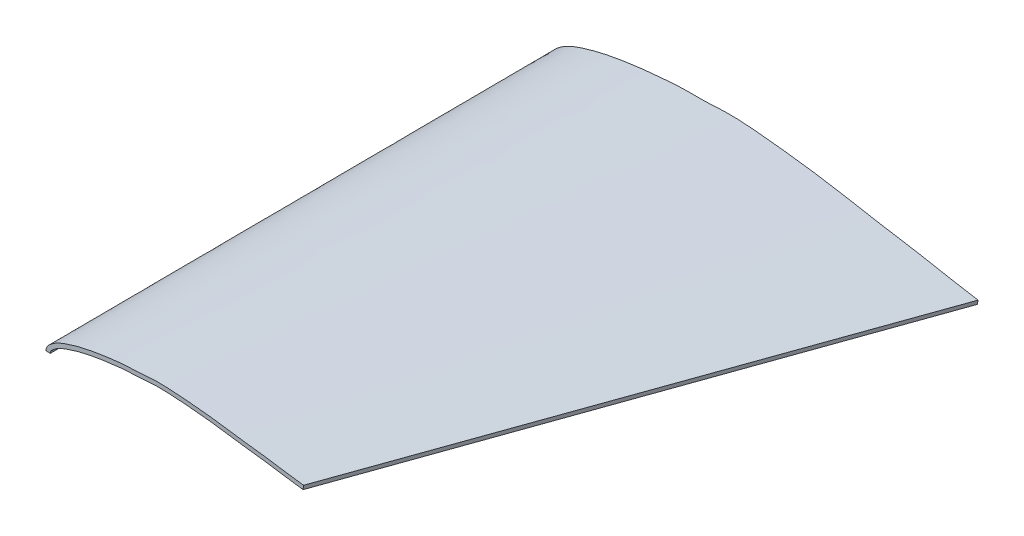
ISO-10303-21;
HEADER;
FILE_DESCRIPTION(('STEP AP214'),'2;1');
FILE_NAME('part.step','',(''),(''),'','','');
FILE_SCHEMA(('AUTOMOTIVE_DESIGN { 1 0 10303 214 1 1 1 1 }'));
ENDSEC;
DATA;
#1=APPLICATION_CONTEXT('core data for automotive mechanical design processes');
#2=APPLICATION_PROTOCOL_DEFINITION('international standard','automotive_design',2000,#1);
#3=PRODUCT_CONTEXT('',#1,'mechanical');
#4=PRODUCT('Part','Part','',(#3));
#5=PRODUCT_RELATED_PRODUCT_CATEGORY('part','',(#4));
#6=PRODUCT_DEFINITION_FORMATION('','',#4);
#7=PRODUCT_DEFINITION_CONTEXT('part definition',#1,'design');
#8=PRODUCT_DEFINITION('design','',#6,#7);
#9=PRODUCT_DEFINITION_SHAPE('','',#8);
#10=(LENGTH_UNIT() NAMED_UNIT(*) SI_UNIT(.MILLI.,.METRE.));
#11=(NAMED_UNIT(*) PLANE_ANGLE_UNIT() SI_UNIT($,.RADIAN.));
#12=(NAMED_UNIT(*) SI_UNIT($,.STERADIAN.) SOLID_ANGLE_UNIT());
#13=UNCERTAINTY_MEASURE_WITH_UNIT(LENGTH_MEASURE(1.E-05),#10,'distance_accuracy_value','');
#14=(GEOMETRIC_REPRESENTATION_CONTEXT(3) GLOBAL_UNCERTAINTY_ASSIGNED_CONTEXT((#13)) GLOBAL_UNIT_ASSIGNED_CONTEXT((#10,
#11,#12)) REPRESENTATION_CONTEXT('',''));
#15=CARTESIAN_POINT('',(0.,0.,0.));
#16=DIRECTION('',(0.,0.,1.));
#17=DIRECTION('',(1.,0.,0.));
#18=AXIS2_PLACEMENT_3D('',#15,#16,#17);
#19=CARTESIAN_POINT('',(0.,0.,120.));
#20=CARTESIAN_POINT('',(0.00175308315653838,0.0405454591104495,120.));
#21=CARTESIAN_POINT('',(0.00350616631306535,0.0810909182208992,120.));
#22=CARTESIAN_POINT('',(0.00995246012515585,0.161434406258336,120.));
#23=CARTESIAN_POINT('',(0.0146456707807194,0.201232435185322,120.));
#24=CARTESIAN_POINT('',(0.0260956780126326,0.259808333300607,120.));
#25=CARTESIAN_POINT('',(0.0306795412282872,0.279141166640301,120.));
#26=CARTESIAN_POINT('',(0.0414926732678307,0.317373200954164,120.));
#27=CARTESIAN_POINT('',(0.0476893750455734,0.336278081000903,120.));
#28=CARTESIAN_POINT('',(0.0684243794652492,0.392354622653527,120.));
#29=CARTESIAN_POINT('',(0.0851075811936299,0.428888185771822,120.));
#30=CARTESIAN_POINT('',(0.141932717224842,0.535898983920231,120.));
#31=CARTESIAN_POINT('',(0.188850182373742,0.603786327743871,120.));
#32=CARTESIAN_POINT('',(0.291131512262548,0.732454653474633,120.));
#33=CARTESIAN_POINT('',(0.345902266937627,0.793011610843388,120.));
#34=CARTESIAN_POINT('',(0.458103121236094,0.908267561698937,120.));
#35=CARTESIAN_POINT('',(0.516014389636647,0.963148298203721,120.));
#36=CARTESIAN_POINT('',(0.634525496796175,1.0704970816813,120.));
#37=CARTESIAN_POINT('',(0.695105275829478,1.12313845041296,120.));
#38=CARTESIAN_POINT('',(0.879966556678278,1.27784320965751,120.));
#39=CARTESIAN_POINT('',(1.00695726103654,1.3765570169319,120.));
#40=CARTESIAN_POINT('',(1.20284124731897,1.51655952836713,120.));
#41=CARTESIAN_POINT('',(1.26915552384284,1.56181293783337,120.));
#42=CARTESIAN_POINT('',(1.40324395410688,1.65016330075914,120.));
#43=CARTESIAN_POINT('',(1.47097674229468,1.69330885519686,120.));
#44=CARTESIAN_POINT('',(1.67542897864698,1.82060454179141,120.));
#45=CARTESIAN_POINT('',(1.81359515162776,1.90246717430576,120.));
#46=CARTESIAN_POINT('',(2.09380568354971,2.05947252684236,120.));
#47=CARTESIAN_POINT('',(2.23587146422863,2.13448981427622,120.));
#48=CARTESIAN_POINT('',(2.5242212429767,2.27584301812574,120.));
#49=CARTESIAN_POINT('',(2.6704604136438,2.34228086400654,120.));
#50=CARTESIAN_POINT('',(2.96539830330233,2.4694392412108,120.));
#51=CARTESIAN_POINT('',(3.11400733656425,2.53028787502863,120.));
#52=CARTESIAN_POINT('',(3.41280317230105,2.64790357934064,120.));
#53=CARTESIAN_POINT('',(3.56302751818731,2.7046170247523,120.));
#54=CARTESIAN_POINT('',(3.86468335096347,2.81486800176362,120.));
#55=CARTESIAN_POINT('',(4.01611483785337,2.86840553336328,120.));
#56=CARTESIAN_POINT('',(4.31973923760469,2.97331758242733,120.));
#57=CARTESIAN_POINT('',(4.47190493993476,3.02476159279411,120.));
#58=CARTESIAN_POINT('',(4.92909970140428,3.1767961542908,120.));
#59=CARTESIAN_POINT('',(5.23497248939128,3.27471617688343,120.));
#60=CARTESIAN_POINT('',(5.84947247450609,3.46114317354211,120.));
#61=CARTESIAN_POINT('',(6.15819189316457,3.54933094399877,120.));
#62=CARTESIAN_POINT('',(7.08841828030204,3.79930863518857,120.));
#63=CARTESIAN_POINT('',(7.71374622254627,3.9473684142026,120.));
#64=CARTESIAN_POINT('',(8.96931374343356,4.22148407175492,120.));
#65=CARTESIAN_POINT('',(9.59915936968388,4.34884443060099,120.));
#66=CARTESIAN_POINT('',(10.8618280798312,4.58512473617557,120.));
#67=CARTESIAN_POINT('',(11.4948241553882,4.6933841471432,120.));
#68=CARTESIAN_POINT('',(12.7640101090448,4.88828377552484,120.));
#69=CARTESIAN_POINT('',(13.400122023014,4.97573522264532,120.));
#70=CARTESIAN_POINT('',(14.3553828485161,5.10184469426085,120.));
#71=CARTESIAN_POINT('',(14.6739815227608,5.14308981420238,120.));
#72=CARTESIAN_POINT('',(15.3113619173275,5.22531492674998,120.));
#73=CARTESIAN_POINT('',(15.630166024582,5.2659778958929,120.));
#74=CARTESIAN_POINT('',(16.5872608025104,5.38007862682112,120.));
#75=CARTESIAN_POINT('',(17.2262343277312,5.4456214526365,120.));
#76=CARTESIAN_POINT('',(18.5078168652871,5.52082227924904,120.));
#77=CARTESIAN_POINT('',(19.1503911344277,5.53106977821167,120.));
#78=CARTESIAN_POINT('',(20.1135868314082,5.5590531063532,120.));
#79=CARTESIAN_POINT('',(20.4345411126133,5.57048289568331,120.));
#80=CARTESIAN_POINT('',(20.9153885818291,5.59748578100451,120.));
#81=CARTESIAN_POINT('',(21.0755659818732,5.60826260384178,120.));
#82=CARTESIAN_POINT('',(21.3957571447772,5.63249880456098,120.));
#83=CARTESIAN_POINT('',(21.5557726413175,5.64592852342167,120.));
#84=CARTESIAN_POINT('',(22.3555939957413,5.71698429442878,120.));
#85=CARTESIAN_POINT('',(22.9946314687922,5.78633187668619,120.));
#86=CARTESIAN_POINT('',(23.7947125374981,5.84623040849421,120.));
#87=CARTESIAN_POINT('',(23.9547984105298,5.85677963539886,120.));
#88=CARTESIAN_POINT('',(24.2751193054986,5.87475827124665,120.));
#89=CARTESIAN_POINT('',(24.4353504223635,5.8822530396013,120.));
#90=CARTESIAN_POINT('',(24.9162269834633,5.90059419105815,120.));
#91=CARTESIAN_POINT('',(25.2370556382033,5.90729742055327,120.));
#92=CARTESIAN_POINT('',(26.8420363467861,5.91773247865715,120.));
#93=CARTESIAN_POINT('',(28.1287007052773,5.85222103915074,120.));
#94=CARTESIAN_POINT('',(30.0553447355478,5.73033139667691,120.));
#95=CARTESIAN_POINT('',(30.6969047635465,5.68686804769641,120.));
#96=CARTESIAN_POINT('',(31.9787305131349,5.59448950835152,120.));
#97=CARTESIAN_POINT('',(32.6190237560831,5.54525759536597,120.));
#98=CARTESIAN_POINT('',(33.8985668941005,5.43884145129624,120.));
#99=CARTESIAN_POINT('',(34.5378167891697,5.38165722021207,120.));
#100=CARTESIAN_POINT('',(35.8154691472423,5.25746940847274,120.));
#101=CARTESIAN_POINT('',(36.4538858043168,5.19018902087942,120.));
#102=CARTESIAN_POINT('',(38.3679973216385,4.97396154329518,120.));
#103=CARTESIAN_POINT('',(39.6425219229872,4.81124838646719,120.));
#104=CARTESIAN_POINT('',(42.1884993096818,4.46378853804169,120.));
#105=CARTESIAN_POINT('',(43.459517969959,4.2771369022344,120.));
#106=CARTESIAN_POINT('',(45.3669494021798,4.00593401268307,120.));
#107=CARTESIAN_POINT('',(46.002947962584,3.91716006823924,120.));
#108=CARTESIAN_POINT('',(46.9578043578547,3.7903723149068,120.));
#109=CARTESIAN_POINT('',(47.276232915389,3.74917192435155,120.));
#110=CARTESIAN_POINT('',(47.9134722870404,3.6695509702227,120.));
#111=CARTESIAN_POINT('',(48.232320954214,3.63140057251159,120.));
#112=CARTESIAN_POINT('',(49.1891476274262,3.51898458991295,120.));
#113=CARTESIAN_POINT('',(49.82732431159,3.44616900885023,120.));
#114=CARTESIAN_POINT('',(50.7825314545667,3.32214056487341,120.));
#115=CARTESIAN_POINT('',(51.1005359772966,3.27793737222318,120.));
#116=CARTESIAN_POINT('',(51.7357701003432,3.18393787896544,120.));
#117=CARTESIAN_POINT('',(52.0530556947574,3.13454243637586,120.));
#118=CARTESIAN_POINT('',(52.6874349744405,3.03431098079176,120.));
#119=CARTESIAN_POINT('',(53.0045286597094,2.98347496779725,120.));
#120=CARTESIAN_POINT('',(53.6389951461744,2.88371319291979,120.));
#121=CARTESIAN_POINT('',(53.9563930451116,2.83496491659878,120.));
#122=CARTESIAN_POINT('',(54.9095252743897,2.69529154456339,120.));
#123=CARTESIAN_POINT('',(55.5459887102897,2.60945688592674,120.));
#124=CARTESIAN_POINT('',(56.8191098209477,2.43914486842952,120.));
#125=CARTESIAN_POINT('',(57.4556071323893,2.35354692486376,120.));
#126=CARTESIAN_POINT('',(58.7279925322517,2.17809391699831,120.));
#127=CARTESIAN_POINT('',(59.3639962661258,2.08904695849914,120.));
#128=CARTESIAN_POINT('',(60.,2.,120.));
#129=CARTESIAN_POINT('',(-0.999066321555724,0.043197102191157,120.000703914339));
#130=CARTESIAN_POINT('',(-0.997312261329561,0.0837655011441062,120.000682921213));
#131=CARTESIAN_POINT('',(-0.995268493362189,0.136412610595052,120.000708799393));
#132=CARTESIAN_POINT('',(-0.984865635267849,0.266066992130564,120.000889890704));
#133=CARTESIAN_POINT('',(-0.97651531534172,0.343268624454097,120.001046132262));
#134=CARTESIAN_POINT('',(-0.950461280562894,0.47655338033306,120.001399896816));
#135=CARTESIAN_POINT('',(-0.939041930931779,0.524887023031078,120.001543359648));
#136=CARTESIAN_POINT('',(-0.913290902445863,0.615933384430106,120.001811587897));
#137=CARTESIAN_POINT('',(-0.898878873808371,0.659735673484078,120.001941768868));
#138=CARTESIAN_POINT('',(-0.852236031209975,0.785876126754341,120.002317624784));
#139=CARTESIAN_POINT('',(-0.816665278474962,0.862902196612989,120.00254829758));
#140=CARTESIAN_POINT('',(-0.704108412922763,1.07486105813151,120.003173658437));
#141=CARTESIAN_POINT('',(-0.621797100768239,1.1910184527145,120.00350230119));
#142=CARTESIAN_POINT('',(-0.463818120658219,1.38975053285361,120.00400388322));
#143=CARTESIAN_POINT('',(-0.389214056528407,1.47146304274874,120.004168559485));
#144=CARTESIAN_POINT('',(-0.239846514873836,1.62489572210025,120.004485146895));
#145=CARTESIAN_POINT('',(-0.16642225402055,1.69423196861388,120.004616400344));
#146=CARTESIAN_POINT('',(-0.0257053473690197,1.82169393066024,120.004789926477));
#147=CARTESIAN_POINT('',(0.0436922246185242,1.88195027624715,120.004855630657));
#148=CARTESIAN_POINT('',(0.257465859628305,2.06084935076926,120.005096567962));
#149=CARTESIAN_POINT('',(0.403191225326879,2.17417237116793,120.005270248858));
#150=CARTESIAN_POINT('',(0.632528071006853,2.33808186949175,120.005638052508));
#151=CARTESIAN_POINT('',(0.710133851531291,2.3910133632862,120.005768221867));
#152=CARTESIAN_POINT('',(0.861884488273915,2.49099992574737,120.005962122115));
#153=CARTESIAN_POINT('',(0.93606026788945,2.53822576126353,120.006025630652));
#154=CARTESIAN_POINT('',(1.15965873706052,2.67744082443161,120.006223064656));
#155=CARTESIAN_POINT('',(1.31033420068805,2.76673720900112,120.006364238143));
#156=CARTESIAN_POINT('',(1.6194663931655,2.93994481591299,120.006750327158));
#157=CARTESIAN_POINT('',(1.77813541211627,3.02376589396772,120.007000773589));
#158=CARTESIAN_POINT('',(2.10163976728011,3.18234770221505,120.007576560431));
#159=CARTESIAN_POINT('',(2.26270166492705,3.25542845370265,120.007823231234));
#160=CARTESIAN_POINT('',(2.58136637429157,3.39281297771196,120.008206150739));
#161=CARTESIAN_POINT('',(2.73904389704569,3.45733706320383,120.008344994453));
#162=CARTESIAN_POINT('',(3.05523862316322,3.58179901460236,120.008621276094));
#163=CARTESIAN_POINT('',(3.21314056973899,3.64139469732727,120.008743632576));
#164=CARTESIAN_POINT('',(3.52804327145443,3.75648531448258,120.008945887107));
#165=CARTESIAN_POINT('',(3.68504449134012,3.81198044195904,120.009025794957));
#166=CARTESIAN_POINT('',(3.99766462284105,3.91999978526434,120.009132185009));
#167=CARTESIAN_POINT('',(4.15282452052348,3.97245248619,120.00914421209));
#168=CARTESIAN_POINT('',(4.62065543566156,4.1280229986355,120.009244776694));
#169=CARTESIAN_POINT('',(4.93492871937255,4.22864991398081,120.009373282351));
#170=CARTESIAN_POINT('',(5.56891515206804,4.42098463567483,120.009780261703));
#171=CARTESIAN_POINT('',(5.88901062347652,4.51241992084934,120.010073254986));
#172=CARTESIAN_POINT('',(6.84826067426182,4.77018912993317,120.010816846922));
#173=CARTESIAN_POINT('',(7.48903822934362,4.92179994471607,120.011240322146));
#174=CARTESIAN_POINT('',(8.76745788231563,5.20089832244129,120.011780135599));
#175=CARTESIAN_POINT('',(9.4051489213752,5.3298253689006,120.011907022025));
#176=CARTESIAN_POINT('',(10.6879959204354,5.56987407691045,120.012511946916));
#177=CARTESIAN_POINT('',(11.3326749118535,5.68012104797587,120.01297480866));
#178=CARTESIAN_POINT('',(12.6226196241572,5.87819692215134,120.013824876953));
#179=CARTESIAN_POINT('',(13.2657107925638,5.96656763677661,120.014054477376));
#180=CARTESIAN_POINT('',(14.2262874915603,6.09337967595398,120.013998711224));
#181=CARTESIAN_POINT('',(14.5451018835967,6.13465377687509,120.013851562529));
#182=CARTESIAN_POINT('',(15.1843767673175,6.21712557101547,120.013687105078));
#183=CARTESIAN_POINT('',(15.5063654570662,6.25820412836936,120.013805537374));
#184=CARTESIAN_POINT('',(16.4797650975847,6.37423399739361,120.014834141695));
#185=CARTESIAN_POINT('',(17.1392505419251,6.44210472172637,120.016485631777));
#186=CARTESIAN_POINT('',(18.4776672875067,6.52054144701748,120.021666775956));
#187=CARTESIAN_POINT('',(19.1300878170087,6.53064986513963,120.0224817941));
#188=CARTESIAN_POINT('',(20.0801877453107,6.55829455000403,120.020507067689));
#189=CARTESIAN_POINT('',(20.3921295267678,6.56949153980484,120.019313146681));
#190=CARTESIAN_POINT('',(20.8525045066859,6.59539181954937,120.016632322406));
#191=CARTESIAN_POINT('',(21.0055378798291,6.60569944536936,120.015688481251));
#192=CARTESIAN_POINT('',(21.3148481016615,6.62913440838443,120.014195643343));
#193=CARTESIAN_POINT('',(21.4705267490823,6.64220139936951,120.013575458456));
#194=CARTESIAN_POINT('',(22.2541602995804,6.71185108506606,120.011137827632));
#195=CARTESIAN_POINT('',(22.8977690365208,6.78181814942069,120.0113122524));
#196=CARTESIAN_POINT('',(23.7256164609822,6.84374852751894,120.014655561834));
#197=CARTESIAN_POINT('',(23.8925589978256,6.85474005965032,120.015507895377));
#198=CARTESIAN_POINT('',(24.2252960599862,6.87339042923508,120.017050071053));
#199=CARTESIAN_POINT('',(24.3915030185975,6.88114953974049,120.017796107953));
#200=CARTESIAN_POINT('',(24.8896012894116,6.90010753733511,120.019954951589));
#201=CARTESIAN_POINT('',(25.2209690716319,6.90698808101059,120.021288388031));
#202=CARTESIAN_POINT('',(26.873883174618,6.91759765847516,120.027379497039));
#203=CARTESIAN_POINT('',(28.1836164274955,6.85028286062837,120.030409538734));
#204=CARTESIAN_POINT('',(30.1225496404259,6.72758392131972,120.031430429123));
#205=CARTESIAN_POINT('',(30.7655660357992,6.68402053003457,120.031349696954));
#206=CARTESIAN_POINT('',(32.0537605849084,6.59116877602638,120.031798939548));
#207=CARTESIAN_POINT('',(32.6977189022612,6.54164735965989,120.032124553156));
#208=CARTESIAN_POINT('',(33.9855461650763,6.43451375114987,120.032996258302));
#209=CARTESIAN_POINT('',(34.6294151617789,6.3769015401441,120.033542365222));
#210=CARTESIAN_POINT('',(35.9172456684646,6.25167868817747,120.034871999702));
#211=CARTESIAN_POINT('',(36.5612664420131,6.18377897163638,120.035667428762));
#212=CARTESIAN_POINT('',(38.4897667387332,5.96585387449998,120.037640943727));
#213=CARTESIAN_POINT('',(39.7719271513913,5.80210347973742,120.038654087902));
#214=CARTESIAN_POINT('',(42.3293264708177,5.45303432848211,120.039926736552));
#215=CARTESIAN_POINT('',(43.6035345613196,5.26590759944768,120.040068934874));
#216=CARTESIAN_POINT('',(45.5059337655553,4.99550788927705,120.03781979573));
#217=CARTESIAN_POINT('',(46.1388953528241,4.90720640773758,120.036722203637));
#218=CARTESIAN_POINT('',(47.0871480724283,4.7813742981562,120.034507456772));
#219=CARTESIAN_POINT('',(47.4030339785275,4.74053304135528,120.03367446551));
#220=CARTESIAN_POINT('',(48.0345035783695,4.66169451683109,120.031811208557));
#221=CARTESIAN_POINT('',(48.3500581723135,4.62396957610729,120.030760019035));
#222=CARTESIAN_POINT('',(49.3035698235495,4.51198565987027,120.029364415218));
#223=CARTESIAN_POINT('',(49.9457766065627,4.43872921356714,120.030111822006));
#224=CARTESIAN_POINT('',(50.916347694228,4.31257964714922,120.033941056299));
#225=CARTESIAN_POINT('',(51.2418598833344,4.26726278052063,120.035910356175));
#226=CARTESIAN_POINT('',(51.8870082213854,4.17170166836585,120.038425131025));
#227=CARTESIAN_POINT('',(52.2075106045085,4.12176564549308,120.039196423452));
#228=CARTESIAN_POINT('',(52.8448635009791,4.02104283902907,120.039734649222));
#229=CARTESIAN_POINT('',(53.1617142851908,3.97025603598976,120.039501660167));
#230=CARTESIAN_POINT('',(53.792233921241,3.8711740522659,120.037993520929));
#231=CARTESIAN_POINT('',(54.1050645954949,3.82318756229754,120.036456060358));
#232=CARTESIAN_POINT('',(55.0468921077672,3.68531038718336,120.032528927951));
#233=CARTESIAN_POINT('',(55.6792244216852,3.60005974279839,120.030903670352));
#234=CARTESIAN_POINT('',(56.9509399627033,3.42996961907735,120.029798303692));
#235=CARTESIAN_POINT('',(57.5907728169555,3.34390058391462,120.030525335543));
#236=CARTESIAN_POINT('',(58.8658993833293,3.16806257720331,120.030751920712));
#237=CARTESIAN_POINT('',(59.5025888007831,3.07892209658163,120.030650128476));
#238=CARTESIAN_POINT('',(60.1385939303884,2.98988509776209,120.03031857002));
#239=B_SPLINE_SURFACE_WITH_KNOTS('',1,3,((#19,#20,#21,#22,#23,#24,#25,#26,#27,#28,#29,#30,#31,
#32,#33,#34,#35,#36,#37,#38,#39,#40,#41,#42,#43,#44,#45,#46,#47,#48,#49,#50,#51,#52,#53,#54,#55,
#56,#57,#58,#59,#60,#61,#62,#63,#64,#65,#66,#67,#68,#69,#70,#71,#72,#73,#74,#75,#76,#77,#78,#79,
#80,#81,#82,#83,#84,#85,#86,#87,#88,#89,#90,#91,#92,#93,#94,#95,#96,#97,#98,#99,#100,#101,#102,
#103,#104,#105,#106,#107,#108,#109,#110,#111,#112,#113,#114,#115,#116,#117,#118,#119,#120,#121,
#122,#123,#124,#125,#126,#127,#128),(#129,#130,#131,#132,#133,#134,#135,#136,#137,#138,#139,
#140,#141,#142,#143,#144,#145,#146,#147,#148,#149,#150,#151,#152,#153,#154,#155,#156,#157,#158,
#159,#160,#161,#162,#163,#164,#165,#166,#167,#168,#169,#170,#171,#172,#173,#174,#175,#176,#177,
#178,#179,#180,#181,#182,#183,#184,#185,#186,#187,#188,#189,#190,#191,#192,#193,#194,#195,#196,
#197,#198,#199,#200,#201,#202,#203,#204,#205,#206,#207,#208,#209,#210,#211,#212,#213,#214,#215,
#216,#217,#218,#219,#220,#221,#222,#223,#224,#225,#226,#227,#228,#229,#230,#231,#232,#233,#234,
#235,#236,#237,#238)),.UNSPECIFIED.,.F.,.F.,.F.,(2,2),(4,2,2,2,2,2,2,2,2,2,2,2,2,2,2,2,2,2,2,2,
2,2,2,2,2,2,2,2,2,2,2,2,2,2,2,2,2,2,2,2,2,2,2,2,2,2,2,2,2,2,2,2,2,2,4),(0.,1.),(0.,0.001953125,
0.00390625,0.0048828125,0.005859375,0.0078125,0.01171875,0.015625,0.01953125,0.0234375,0.03125,
0.03515625,0.0390625,0.046875,0.0546875,0.0625,0.0703125,0.078125,0.0859375,0.09375,0.109375,
0.125,0.15625,0.1875,0.21875,0.25,0.265625,0.28125,0.3125,0.34375,0.359375,0.3671875,0.375,
0.40625,0.4140625,0.421875,0.4375,0.5,0.53125,0.5625,0.59375,0.625,0.6875,0.75,0.78125,0.796875,
0.8125,0.84375,0.859375,0.875,0.890625,0.90625,0.9375,0.96875,1.),.UNSPECIFIED.);
#240=CARTESIAN_POINT('',(60.1385939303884,2.98988509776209,120.03031857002));
#241=CARTESIAN_POINT('',(60.,2.,120.));
#242=B_SPLINE_CURVE_WITH_KNOTS('',1,(#240,#241),.UNSPECIFIED.,.F.,.F.,(2,2),(0.,1.),.UNSPECIFIED.);
#243=CARTESIAN_POINT('',(60.1385939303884,2.98988509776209,120.03031857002));
#244=VERTEX_POINT('',#243);
#245=CARTESIAN_POINT('',(60.,2.,120.));
#246=VERTEX_POINT('',#245);
#247=EDGE_CURVE('E14',#244,#246,#242,.T.);
#248=CARTESIAN_POINT('',(60.1385939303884,2.98988509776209,120.03031857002));
#249=CARTESIAN_POINT('',(59.5025888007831,3.07892209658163,120.030650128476));
#250=CARTESIAN_POINT('',(58.8658993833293,3.16806257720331,120.030751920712));
#251=CARTESIAN_POINT('',(57.5907728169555,3.34390058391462,120.030525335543));
#252=CARTESIAN_POINT('',(56.9509399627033,3.42996961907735,120.029798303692));
#253=CARTESIAN_POINT('',(55.6792244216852,3.60005974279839,120.030903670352));
#254=CARTESIAN_POINT('',(55.0468921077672,3.68531038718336,120.032528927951));
#255=CARTESIAN_POINT('',(54.1050645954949,3.82318756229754,120.036456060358));
#256=CARTESIAN_POINT('',(53.792233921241,3.8711740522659,120.037993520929));
#257=CARTESIAN_POINT('',(53.1617142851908,3.97025603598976,120.039501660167));
#258=CARTESIAN_POINT('',(52.8448635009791,4.02104283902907,120.039734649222));
#259=CARTESIAN_POINT('',(52.2075106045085,4.12176564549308,120.039196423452));
#260=CARTESIAN_POINT('',(51.8870082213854,4.17170166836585,120.038425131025));
#261=CARTESIAN_POINT('',(51.2418598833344,4.26726278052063,120.035910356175));
#262=CARTESIAN_POINT('',(50.916347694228,4.31257964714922,120.033941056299));
#263=CARTESIAN_POINT('',(49.9457766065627,4.43872921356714,120.030111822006));
#264=CARTESIAN_POINT('',(49.3035698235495,4.51198565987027,120.029364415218));
#265=CARTESIAN_POINT('',(48.3500581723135,4.62396957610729,120.030760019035));
#266=CARTESIAN_POINT('',(48.0345035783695,4.66169451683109,120.031811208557));
#267=CARTESIAN_POINT('',(47.4030339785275,4.74053304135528,120.03367446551));
#268=CARTESIAN_POINT('',(47.0871480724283,4.7813742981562,120.034507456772));
#269=CARTESIAN_POINT('',(46.1388953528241,4.90720640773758,120.036722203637));
#270=CARTESIAN_POINT('',(45.5059337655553,4.99550788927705,120.03781979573));
#271=CARTESIAN_POINT('',(43.6035345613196,5.26590759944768,120.040068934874));
#272=CARTESIAN_POINT('',(42.3293264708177,5.45303432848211,120.039926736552));
#273=CARTESIAN_POINT('',(39.7719271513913,5.80210347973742,120.038654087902));
#274=CARTESIAN_POINT('',(38.4897667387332,5.96585387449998,120.037640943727));
#275=CARTESIAN_POINT('',(36.5612664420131,6.18377897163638,120.035667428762));
#276=CARTESIAN_POINT('',(35.9172456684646,6.25167868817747,120.034871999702));
#277=CARTESIAN_POINT('',(34.6294151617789,6.3769015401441,120.033542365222));
#278=CARTESIAN_POINT('',(33.9855461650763,6.43451375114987,120.032996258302));
#279=CARTESIAN_POINT('',(32.6977189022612,6.54164735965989,120.032124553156));
#280=CARTESIAN_POINT('',(32.0537605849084,6.59116877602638,120.031798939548));
#281=CARTESIAN_POINT('',(30.7655660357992,6.68402053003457,120.031349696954));
#282=CARTESIAN_POINT('',(30.1225496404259,6.72758392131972,120.031430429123));
#283=CARTESIAN_POINT('',(28.1836164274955,6.85028286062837,120.030409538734));
#284=CARTESIAN_POINT('',(26.873883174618,6.91759765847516,120.027379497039));
#285=CARTESIAN_POINT('',(25.2209690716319,6.90698808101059,120.021288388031));
#286=CARTESIAN_POINT('',(24.8896012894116,6.90010753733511,120.019954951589));
#287=CARTESIAN_POINT('',(24.3915030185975,6.88114953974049,120.017796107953));
#288=CARTESIAN_POINT('',(24.2252960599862,6.87339042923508,120.017050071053));
#289=CARTESIAN_POINT('',(23.8925589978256,6.85474005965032,120.015507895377));
#290=CARTESIAN_POINT('',(23.7256164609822,6.84374852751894,120.014655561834));
#291=CARTESIAN_POINT('',(22.8977690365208,6.78181814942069,120.0113122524));
#292=CARTESIAN_POINT('',(22.2541602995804,6.71185108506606,120.011137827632));
#293=CARTESIAN_POINT('',(21.4705267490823,6.64220139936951,120.013575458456));
#294=CARTESIAN_POINT('',(21.3148481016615,6.62913440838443,120.014195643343));
#295=CARTESIAN_POINT('',(21.0055378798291,6.60569944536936,120.015688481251));
#296=CARTESIAN_POINT('',(20.8525045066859,6.59539181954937,120.016632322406));
#297=CARTESIAN_POINT('',(20.3921295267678,6.56949153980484,120.019313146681));
#298=CARTESIAN_POINT('',(20.0801877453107,6.55829455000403,120.020507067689));
#299=CARTESIAN_POINT('',(19.1300878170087,6.53064986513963,120.0224817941));
#300=CARTESIAN_POINT('',(18.4776672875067,6.52054144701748,120.021666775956));
#301=CARTESIAN_POINT('',(17.1392505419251,6.44210472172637,120.016485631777));
#302=CARTESIAN_POINT('',(16.4797650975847,6.37423399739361,120.014834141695));
#303=CARTESIAN_POINT('',(15.5063654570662,6.25820412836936,120.013805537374));
#304=CARTESIAN_POINT('',(15.1843767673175,6.21712557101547,120.013687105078));
#305=CARTESIAN_POINT('',(14.5451018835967,6.13465377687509,120.013851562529));
#306=CARTESIAN_POINT('',(14.2262874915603,6.09337967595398,120.013998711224));
#307=CARTESIAN_POINT('',(13.2657107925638,5.96656763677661,120.014054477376));
#308=CARTESIAN_POINT('',(12.6226196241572,5.87819692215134,120.013824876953));
#309=CARTESIAN_POINT('',(11.3326749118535,5.68012104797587,120.01297480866));
#310=CARTESIAN_POINT('',(10.6879959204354,5.56987407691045,120.012511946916));
#311=CARTESIAN_POINT('',(9.4051489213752,5.3298253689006,120.011907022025));
#312=CARTESIAN_POINT('',(8.76745788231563,5.20089832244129,120.011780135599));
#313=CARTESIAN_POINT('',(7.48903822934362,4.92179994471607,120.011240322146));
#314=CARTESIAN_POINT('',(6.84826067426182,4.77018912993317,120.010816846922));
#315=CARTESIAN_POINT('',(5.88901062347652,4.51241992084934,120.010073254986));
#316=CARTESIAN_POINT('',(5.56891515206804,4.42098463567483,120.009780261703));
#317=CARTESIAN_POINT('',(4.93492871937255,4.22864991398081,120.009373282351));
#318=CARTESIAN_POINT('',(4.62065543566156,4.1280229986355,120.009244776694));
#319=CARTESIAN_POINT('',(4.15282452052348,3.97245248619,120.00914421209));
#320=CARTESIAN_POINT('',(3.99766462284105,3.91999978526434,120.009132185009));
#321=CARTESIAN_POINT('',(3.68504449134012,3.81198044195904,120.009025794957));
#322=CARTESIAN_POINT('',(3.52804327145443,3.75648531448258,120.008945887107));
#323=CARTESIAN_POINT('',(3.21314056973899,3.64139469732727,120.008743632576));
#324=CARTESIAN_POINT('',(3.05523862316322,3.58179901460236,120.008621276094));
#325=CARTESIAN_POINT('',(2.73904389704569,3.45733706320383,120.008344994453));
#326=CARTESIAN_POINT('',(2.58136637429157,3.39281297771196,120.008206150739));
#327=CARTESIAN_POINT('',(2.26270166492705,3.25542845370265,120.007823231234));
#328=CARTESIAN_POINT('',(2.10163976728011,3.18234770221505,120.007576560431));
#329=CARTESIAN_POINT('',(1.77813541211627,3.02376589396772,120.007000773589));
#330=CARTESIAN_POINT('',(1.6194663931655,2.93994481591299,120.006750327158));
#331=CARTESIAN_POINT('',(1.31033420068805,2.76673720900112,120.006364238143));
#332=CARTESIAN_POINT('',(1.15965873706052,2.67744082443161,120.006223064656));
#333=CARTESIAN_POINT('',(0.93606026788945,2.53822576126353,120.006025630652));
#334=CARTESIAN_POINT('',(0.861884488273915,2.49099992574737,120.005962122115));
#335=CARTESIAN_POINT('',(0.710133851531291,2.3910133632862,120.005768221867));
#336=CARTESIAN_POINT('',(0.632528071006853,2.33808186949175,120.005638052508));
#337=CARTESIAN_POINT('',(0.403191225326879,2.17417237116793,120.005270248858));
#338=CARTESIAN_POINT('',(0.257465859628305,2.06084935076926,120.005096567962));
#339=CARTESIAN_POINT('',(0.0436922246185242,1.88195027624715,120.004855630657));
#340=CARTESIAN_POINT('',(-0.0257053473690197,1.82169393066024,120.004789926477));
#341=CARTESIAN_POINT('',(-0.16642225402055,1.69423196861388,120.004616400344));
#342=CARTESIAN_POINT('',(-0.239846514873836,1.62489572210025,120.004485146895));
#343=CARTESIAN_POINT('',(-0.389214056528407,1.47146304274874,120.004168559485));
#344=CARTESIAN_POINT('',(-0.463818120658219,1.38975053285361,120.00400388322));
#345=CARTESIAN_POINT('',(-0.621797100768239,1.1910184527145,120.00350230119));
#346=CARTESIAN_POINT('',(-0.704108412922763,1.07486105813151,120.003173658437));
#347=CARTESIAN_POINT('',(-0.816665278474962,0.862902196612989,120.00254829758));
#348=CARTESIAN_POINT('',(-0.852236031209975,0.785876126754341,120.002317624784));
#349=CARTESIAN_POINT('',(-0.898878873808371,0.659735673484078,120.001941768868));
#350=CARTESIAN_POINT('',(-0.913290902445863,0.615933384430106,120.001811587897));
#351=CARTESIAN_POINT('',(-0.939041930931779,0.524887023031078,120.001543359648));
#352=CARTESIAN_POINT('',(-0.950461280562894,0.47655338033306,120.001399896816));
#353=CARTESIAN_POINT('',(-0.97651531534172,0.343268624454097,120.001046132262));
#354=CARTESIAN_POINT('',(-0.984865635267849,0.266066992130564,120.000889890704));
#355=CARTESIAN_POINT('',(-0.995268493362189,0.136412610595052,120.000708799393));
#356=CARTESIAN_POINT('',(-0.997312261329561,0.0837655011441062,120.000682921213));
#357=CARTESIAN_POINT('',(-0.999066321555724,0.043197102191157,120.000703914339));
#358=B_SPLINE_CURVE_WITH_KNOTS('',3,(#248,#249,#250,#251,#252,#253,#254,#255,#256,#257,#258,
#259,#260,#261,#262,#263,#264,#265,#266,#267,#268,#269,#270,#271,#272,#273,#274,#275,#276,#277,
#278,#279,#280,#281,#282,#283,#284,#285,#286,#287,#288,#289,#290,#291,#292,#293,#294,#295,#296,
#297,#298,#299,#300,#301,#302,#303,#304,#305,#306,#307,#308,#309,#310,#311,#312,#313,#314,#315,
#316,#317,#318,#319,#320,#321,#322,#323,#324,#325,#326,#327,#328,#329,#330,#331,#332,#333,#334,
#335,#336,#337,#338,#339,#340,#341,#342,#343,#344,#345,#346,#347,#348,#349,#350,#351,#352,#353,
#354,#355,#356,#357),.UNSPECIFIED.,.F.,.F.,(4,2,2,2,2,2,2,2,2,2,2,2,2,2,2,2,2,2,2,2,2,2,2,2,2,2,
2,2,2,2,2,2,2,2,2,2,2,2,2,2,2,2,2,2,2,2,2,2,2,2,2,2,2,2,4),(0.,0.03125,0.0625,0.09375,0.109375,
0.125,0.140625,0.15625,0.1875,0.203125,0.21875,0.25,0.3125,0.375,0.40625,0.4375,0.46875,0.5,
0.5625,0.578125,0.5859375,0.59375,0.625,0.6328125,0.640625,0.65625,0.6875,0.71875,0.734375,0.75,
0.78125,0.8125,0.84375,0.875,0.890625,0.90625,0.9140625,0.921875,0.9296875,0.9375,0.9453125,
0.953125,0.9609375,0.96484375,0.96875,0.9765625,0.98046875,0.984375,0.98828125,0.9921875,
0.994140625,0.9951171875,0.99609375,0.998046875,1.),.UNSPECIFIED.);
#359=CARTESIAN_POINT('',(-0.999066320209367,0.0431971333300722,120.000703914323));
#360=VERTEX_POINT('',#359);
#361=EDGE_CURVE('E119',#244,#360,#358,.T.);
#362=CARTESIAN_POINT('',(-0.999066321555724,0.043197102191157,120.000703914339));
#363=CARTESIAN_POINT('',(0.,0.,120.));
#364=B_SPLINE_CURVE_WITH_KNOTS('',1,(#362,#363),.UNSPECIFIED.,.F.,.F.,(2,2),(0.,1.),.UNSPECIFIED.);
#365=CARTESIAN_POINT('',(0.,0.,120.));
#366=VERTEX_POINT('',#365);
#367=EDGE_CURVE('E66',#360,#366,#364,.T.);
#368=CARTESIAN_POINT('',(60.,2.,120.));
#369=CARTESIAN_POINT('',(58.994472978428,2.14078395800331,120.));
#370=CARTESIAN_POINT('',(56.9834189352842,2.42235187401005,120.));
#371=CARTESIAN_POINT('',(53.9595173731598,2.81376177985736,120.));
#372=CARTESIAN_POINT('',(50.9561996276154,3.33025396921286,120.));
#373=CARTESIAN_POINT('',(46.9160358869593,3.76090083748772,120.));
#374=CARTESIAN_POINT('',(41.9045594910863,4.52358757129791,120.));
#375=CARTESIAN_POINT('',(35.8802994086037,5.30140370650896,120.));
#376=CARTESIAN_POINT('',(29.8606688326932,5.76520445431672,120.));
#377=CARTESIAN_POINT('',(24.8280110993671,6.03709424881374,120.));
#378=CARTESIAN_POINT('',(20.8480315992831,5.52588906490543,120.));
#379=CARTESIAN_POINT('',(17.8385358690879,5.54924089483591,120.));
#380=CARTESIAN_POINT('',(14.8514224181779,5.16741025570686,120.));
#381=CARTESIAN_POINT('',(11.8595113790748,4.77623654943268,120.));
#382=CARTESIAN_POINT('',(8.87361387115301,4.22090127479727,120.));
#383=CARTESIAN_POINT('',(6.38718119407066,3.64403894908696,120.));
#384=CARTESIAN_POINT('',(4.41916888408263,3.01594864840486,120.));
#385=CARTESIAN_POINT('',(3.23071299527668,2.59209265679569,120.));
#386=CARTESIAN_POINT('',(2.34800734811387,2.19938178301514,120.));
#387=CARTESIAN_POINT('',(1.86158366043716,1.9334986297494,120.));
#388=CARTESIAN_POINT('',(1.47326535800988,1.69663080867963,120.));
#389=CARTESIAN_POINT('',(1.17769074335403,1.50287187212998,120.));
#390=CARTESIAN_POINT('',(0.885159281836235,1.28388984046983,120.));
#391=CARTESIAN_POINT('',(0.590162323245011,1.03599065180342,120.));
#392=CARTESIAN_POINT('',(0.268716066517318,0.728071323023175,120.));
#393=CARTESIAN_POINT('',(0.016036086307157,0.370883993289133,120.));
#394=CARTESIAN_POINT('',(0.00394717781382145,0.0912906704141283,120.));
#395=CARTESIAN_POINT('',(0.,0.,120.));
#396=B_SPLINE_CURVE_WITH_KNOTS('',3,(#368,#369,#370,#371,#372,#373,#374,#375,#376,#377,#378,
#379,#380,#381,#382,#383,#384,#385,#386,#387,#388,#389,#390,#391,#392,#393,#394,#395),
.UNSPECIFIED.,.F.,.F.,(4,1,1,1,1,1,1,1,1,1,1,1,1,1,1,1,1,1,1,1,1,1,1,1,1,4),(0.,
0.0494065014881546,0.0988130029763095,0.148358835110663,0.197636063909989,0.296447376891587,
0.395029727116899,0.493031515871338,0.590488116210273,0.639198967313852,0.687854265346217,
0.736621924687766,0.785527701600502,0.834698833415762,0.884356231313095,0.909585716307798,
0.935194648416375,0.945704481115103,0.956562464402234,0.9621389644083,0.967838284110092,
0.973749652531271,0.979920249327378,0.986531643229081,0.995602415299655,1.),.UNSPECIFIED.);
#397=EDGE_CURVE('E174',#246,#366,#396,.T.);
#398=ORIENTED_EDGE('',*,*,#247,.F.);
#399=ORIENTED_EDGE('',*,*,#361,.T.);
#400=ORIENTED_EDGE('',*,*,#367,.T.);
#401=ORIENTED_EDGE('',*,*,#397,.F.);
#402=EDGE_LOOP('',(#398,#399,#400,#401));
#403=FACE_BOUND('',#402,.T.);
#404=ADVANCED_FACE('F52',(#403),#239,.F.);
#405=CARTESIAN_POINT('',(0.,0.,120.));
#406=CARTESIAN_POINT('',(-0.0214666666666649,0.155333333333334,79.9999999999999));
#407=CARTESIAN_POINT('',(-0.0429333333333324,0.310666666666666,40.0000000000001));
#408=CARTESIAN_POINT('',(-0.0644,0.466,0.));
#409=CARTESIAN_POINT('',(-0.999066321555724,0.043197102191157,120.000703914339));
#410=CARTESIAN_POINT('',(-1.01963962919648,0.219190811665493,80.0007842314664));
#411=CARTESIAN_POINT('',(-1.04029760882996,0.383599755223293,40.0008181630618));
#412=CARTESIAN_POINT('',(-1.06116616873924,0.54635227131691,0.000846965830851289));
#413=B_SPLINE_SURFACE_WITH_KNOTS('',1,3,((#405,#406,#407,#408),(#409,#410,#411,#412)),
.UNSPECIFIED.,.F.,.F.,.F.,(2,2),(4,4),(0.,1.),(-0.0600004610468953,0.0600004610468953),.UNSPECIFIED.);
#414=CARTESIAN_POINT('',(-0.999066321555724,0.043197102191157,120.000703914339));
#415=CARTESIAN_POINT('',(-1.01963962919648,0.219190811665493,80.0007842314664));
#416=CARTESIAN_POINT('',(-1.04029760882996,0.383599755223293,40.0008181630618));
#417=CARTESIAN_POINT('',(-1.06116616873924,0.54635227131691,0.000846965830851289));
#418=B_SPLINE_CURVE_WITH_KNOTS('',3,(#414,#415,#416,#417),.UNSPECIFIED.,.F.,.F.,(4,4),
(-0.0600004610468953,0.0600004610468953),.UNSPECIFIED.);
#419=CARTESIAN_POINT('',(-1.06116616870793,0.546352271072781,0.000847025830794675));
#420=VERTEX_POINT('',#419);
#421=EDGE_CURVE('E112',#360,#420,#418,.T.);
#422=CARTESIAN_POINT('',(-1.06116616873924,0.54635227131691,0.000846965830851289));
#423=CARTESIAN_POINT('',(-0.0644,0.466,0.));
#424=B_SPLINE_CURVE_WITH_KNOTS('',1,(#422,#423),.UNSPECIFIED.,.F.,.F.,(2,2),(0.,1.),.UNSPECIFIED.);
#425=CARTESIAN_POINT('',(-0.0644,0.466,0.));
#426=VERTEX_POINT('',#425);
#427=EDGE_CURVE('E94',#420,#426,#424,.T.);
#428=CARTESIAN_POINT('',(0.,0.,120.));
#429=CARTESIAN_POINT('',(-0.0644,0.466,0.));
#430=B_SPLINE_CURVE_WITH_KNOTS('',1,(#428,#429),.UNSPECIFIED.,.F.,.F.,(2,2),(0.,1.),.UNSPECIFIED.);
#431=EDGE_CURVE('E128',#366,#426,#430,.T.);
#432=ORIENTED_EDGE('',*,*,#367,.F.);
#433=ORIENTED_EDGE('',*,*,#421,.T.);
#434=ORIENTED_EDGE('',*,*,#427,.T.);
#435=ORIENTED_EDGE('',*,*,#431,.F.);
#436=EDGE_LOOP('',(#432,#433,#434,#435));
#437=FACE_BOUND('',#436,.T.);
#438=ADVANCED_FACE('F114',(#437),#413,.T.);
#439=CARTESIAN_POINT('',(-0.0644,0.466,0.));
#440=CARTESIAN_POINT('',(-0.0589645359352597,0.533426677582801,0.));
#441=CARTESIAN_POINT('',(-0.0535290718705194,0.600853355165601,0.));
#442=CARTESIAN_POINT('',(-0.0378072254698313,0.734279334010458,0.));
#443=CARTESIAN_POINT('',(-0.0275208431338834,0.800278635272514,0.));
#444=CARTESIAN_POINT('',(-0.00481489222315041,0.89713652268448,0.));
#445=CARTESIAN_POINT('',(0.00401971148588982,0.929054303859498,0.));
#446=CARTESIAN_POINT('',(0.0244027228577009,0.992065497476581,0.));
#447=CARTESIAN_POINT('',(0.0358972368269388,1.02317038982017,0.));
#448=CARTESIAN_POINT('',(0.0739138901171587,1.11528913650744,0.));
#449=CARTESIAN_POINT('',(0.103969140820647,1.17510706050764,0.));
#450=CARTESIAN_POINT('',(0.205260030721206,1.34982657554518,0.));
#451=CARTESIAN_POINT('',(0.287620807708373,1.45999390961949,0.));
#452=CARTESIAN_POINT('',(0.465970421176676,1.66796770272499,0.));
#453=CARTESIAN_POINT('',(0.560957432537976,1.76543780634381,0.));
#454=CARTESIAN_POINT('',(0.754997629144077,1.95045558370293,0.));
#455=CARTESIAN_POINT('',(0.854863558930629,2.03827613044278,0.));
#456=CARTESIAN_POINT('',(1.05892401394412,2.20973167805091,0.));
#457=CARTESIAN_POINT('',(1.1630958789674,2.29365662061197,0.));
#458=CARTESIAN_POINT('',(1.48061188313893,2.5398753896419,0.));
#459=CARTESIAN_POINT('',(1.69826086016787,2.69642183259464,0.));
#460=CARTESIAN_POINT('',(2.03322496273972,2.91746764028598,0.));
#461=CARTESIAN_POINT('',(2.14649027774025,2.98873090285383,0.));
#462=CARTESIAN_POINT('',(2.37531879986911,3.12757491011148,0.));
#463=CARTESIAN_POINT('',(2.49081612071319,3.19523917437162,0.));
#464=CARTESIAN_POINT('',(2.83926379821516,3.39458801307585,0.));
#465=CARTESIAN_POINT('',(3.07448200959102,3.52237260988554,0.));
#466=CARTESIAN_POINT('',(3.55096132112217,3.76650803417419,0.));
#467=CARTESIAN_POINT('',(3.79225032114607,3.88264860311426,0.));
#468=CARTESIAN_POINT('',(4.28131590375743,4.1002077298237,0.));
#469=CARTESIAN_POINT('',(4.52902414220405,4.20179884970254,0.));
#470=CARTESIAN_POINT('',(5.02818272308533,4.39530533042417,0.));
#471=CARTESIAN_POINT('',(5.27949162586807,4.48743963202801,0.));
#472=CARTESIAN_POINT('',(5.78448426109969,4.66481180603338,0.));
#473=CARTESIAN_POINT('',(6.03822720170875,4.74995802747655,0.));
#474=CARTESIAN_POINT('',(6.54752675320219,4.9148855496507,0.));
#475=CARTESIAN_POINT('',(6.80308336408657,4.99466685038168,0.));
#476=CARTESIAN_POINT('',(7.31533068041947,5.15057934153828,0.));
#477=CARTESIAN_POINT('',(7.57198037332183,5.22682797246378,0.));
#478=CARTESIAN_POINT('',(8.34294898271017,5.45170375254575,0.));
#479=CARTESIAN_POINT('',(8.85850759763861,5.59583033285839,0.));
#480=CARTESIAN_POINT('',(9.89362879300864,5.86823356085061,0.));
#481=CARTESIAN_POINT('',(10.4133251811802,5.99597279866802,0.));
#482=CARTESIAN_POINT('',(11.9782856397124,6.35464326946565,0.));
#483=CARTESIAN_POINT('',(13.0290623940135,6.56246753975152,0.));
#484=CARTESIAN_POINT('',(14.610339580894,6.84648694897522,0.));
#485=CARTESIAN_POINT('',(15.1382335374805,6.93673327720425,0.));
#486=CARTESIAN_POINT('',(16.1949851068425,7.11013911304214,0.));
#487=CARTESIAN_POINT('',(16.7239121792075,7.19303331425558,0.));
#488=CARTESIAN_POINT('',(18.3123001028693,7.4294563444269,0.));
#489=CARTESIAN_POINT('',(19.3733802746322,7.57051053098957,0.));
#490=CARTESIAN_POINT('',(21.4995192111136,7.81641027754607,0.));
#491=CARTESIAN_POINT('',(22.5644984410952,7.9226119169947,0.));
#492=CARTESIAN_POINT('',(24.1634733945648,8.07340544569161,0.));
#493=CARTESIAN_POINT('',(24.6967131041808,8.1223407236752,0.));
#494=CARTESIAN_POINT('',(25.7634809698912,8.21975830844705,0.));
#495=CARTESIAN_POINT('',(26.297026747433,8.26771116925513,0.));
#496=CARTESIAN_POINT('',(27.8983114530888,8.39838829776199,0.));
#497=CARTESIAN_POINT('',(28.9666979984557,8.46791982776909,0.));
#498=CARTESIAN_POINT('',(31.1060595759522,8.51367155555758,0.));
#499=CARTESIAN_POINT('',(32.1770133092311,8.49087581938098,0.));
#500=CARTESIAN_POINT('',(33.7831175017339,8.477731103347,0.));
#501=CARTESIAN_POINT('',(34.3184311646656,8.47685767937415,0.));
#502=CARTESIAN_POINT('',(35.1210405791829,8.49200430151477,0.));
#503=CARTESIAN_POINT('',(35.3885121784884,8.50001769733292,0.));
#504=CARTESIAN_POINT('',(35.9233492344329,8.52052289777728,0.));
#505=CARTESIAN_POINT('',(36.1907157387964,8.53296519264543,0.));
#506=CARTESIAN_POINT('',(37.5273640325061,8.60170063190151,0.));
#507=CARTESIAN_POINT('',(38.5960931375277,8.67756567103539,0.));
#508=CARTESIAN_POINT('',(39.9324818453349,8.72770069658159,0.));
#509=CARTESIAN_POINT('',(40.1997868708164,8.7353406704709,0.));
#510=CARTESIAN_POINT('',(40.734451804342,8.74541477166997,0.));
#511=CARTESIAN_POINT('',(41.0018092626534,8.74795800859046,0.));
#512=CARTESIAN_POINT('',(41.8039297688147,8.74867521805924,0.));
#513=CARTESIAN_POINT('',(42.3387409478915,8.73993668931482,0.));
#514=CARTESIAN_POINT('',(45.0127598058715,8.65774656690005,0.));
#515=CARTESIAN_POINT('',(47.1518563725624,8.46880253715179,0.));
#516=CARTESIAN_POINT('',(50.353451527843,8.14624716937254,0.));
#517=CARTESIAN_POINT('',(51.4193836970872,8.03404969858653,0.));
#518=CARTESIAN_POINT('',(53.5487539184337,7.80065407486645,0.));
#519=CARTESIAN_POINT('',(54.612218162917,7.67892665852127,0.));
#520=CARTESIAN_POINT('',(56.736915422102,7.42229060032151,0.));
#521=CARTESIAN_POINT('',(57.7981484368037,7.28738195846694,0.));
#522=CARTESIAN_POINT('',(59.9185937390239,7.00126143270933,0.));
#523=CARTESIAN_POINT('',(60.9778124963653,6.84958759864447,0.));
#524=CARTESIAN_POINT('',(64.1526799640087,6.37067384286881,0.));
#525=CARTESIAN_POINT('',(66.2655253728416,6.02057677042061,0.));
#526=CARTESIAN_POINT('',(69.4299308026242,5.46804860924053,0.));
#527=CARTESIAN_POINT('',(70.4838320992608,5.27897198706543,0.));
#528=CARTESIAN_POINT('',(72.5906673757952,4.89681774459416,0.));
#529=CARTESIAN_POINT('',(73.6436964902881,4.70409588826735,0.));
#530=CARTESIAN_POINT('',(75.7505831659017,4.32404899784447,0.));
#531=CARTESIAN_POINT('',(76.8044407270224,4.13672396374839,0.));
#532=CARTESIAN_POINT('',(78.3870525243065,3.86629874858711,0.));
#533=CARTESIAN_POINT('',(78.9148940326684,3.77791739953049,0.));
#534=CARTESIAN_POINT('',(79.9713862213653,3.60576126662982,0.));
#535=CARTESIAN_POINT('',(80.5001167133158,3.52243414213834,0.));
#536=CARTESIAN_POINT('',(82.0869019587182,3.27582534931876,0.));
#537=CARTESIAN_POINT('',(83.1453776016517,3.11494658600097,0.));
#538=CARTESIAN_POINT('',(84.7287448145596,2.84909571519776,0.));
#539=CARTESIAN_POINT('',(85.2556937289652,2.75573898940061,0.));
#540=CARTESIAN_POINT('',(86.3079537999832,2.55975732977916,0.));
#541=CARTESIAN_POINT('',(86.8333830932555,2.45779662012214,0.));
#542=CARTESIAN_POINT('',(87.8838326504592,2.25148758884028,0.));
#543=CARTESIAN_POINT('',(88.4088529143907,2.14713926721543,0.));
#544=CARTESIAN_POINT('',(89.4594768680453,1.94160715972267,0.));
#545=CARTESIAN_POINT('',(89.9851333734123,1.84071744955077,0.));
#546=CARTESIAN_POINT('',(91.5640738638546,1.54893598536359,0.));
#547=CARTESIAN_POINT('',(92.6188881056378,1.36647799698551,0.));
#548=CARTESIAN_POINT('',(94.72892433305,1.00381078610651,0.));
#549=CARTESIAN_POINT('',(95.7838096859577,0.821744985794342,0.));
#550=CARTESIAN_POINT('',(97.8923015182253,0.450560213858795,0.));
#551=CARTESIAN_POINT('',(98.9461507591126,0.262780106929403,0.));
#552=CARTESIAN_POINT('',(100.,0.075,0.));
#553=CARTESIAN_POINT('',(-1.06116616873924,0.54635227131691,0.000846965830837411));
#554=CARTESIAN_POINT('',(-1.05572887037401,0.61380183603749,0.000834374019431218));
#555=CARTESIAN_POINT('',(-1.04955249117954,0.693310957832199,0.000868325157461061));
#556=CARTESIAN_POINT('',(-1.02804143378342,0.875866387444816,0.0010644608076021));
#557=CARTESIAN_POINT('',(-1.01270828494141,0.979107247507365,0.00122767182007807));
#558=CARTESIAN_POINT('',(-0.972627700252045,1.15007863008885,0.00158988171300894));
#559=CARTESIAN_POINT('',(-0.955882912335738,1.21072269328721,0.0017357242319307));
#560=CARTESIAN_POINT('',(-0.918606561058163,1.3259555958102,0.00200854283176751));
#561=CARTESIAN_POINT('',(-0.897975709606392,1.38163485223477,0.00214089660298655));
#562=CARTESIAN_POINT('',(-0.831461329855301,1.54280461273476,0.00252308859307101));
#563=CARTESIAN_POINT('',(-0.7810244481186,1.64238394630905,0.00275775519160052));
#564=CARTESIAN_POINT('',(-0.620134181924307,1.91990433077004,0.00339550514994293));
#565=CARTESIAN_POINT('',(-0.500607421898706,2.07699081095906,0.00373307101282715));
#566=CARTESIAN_POINT('',(-0.263990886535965,2.35290655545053,0.00425573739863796));
#567=CARTESIAN_POINT('',(-0.148396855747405,2.47077926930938,0.00443260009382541));
#568=CARTESIAN_POINT('',(0.084205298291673,2.69256379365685,0.00477359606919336));
#569=CARTESIAN_POINT('',(0.200111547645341,2.79425234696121,0.00491757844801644));
#570=CARTESIAN_POINT('',(0.427111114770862,2.98498046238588,0.00511875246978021));
#571=CARTESIAN_POINT('',(0.540378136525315,3.07618682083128,0.00519888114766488));
#572=CARTESIAN_POINT('',(0.88768710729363,3.34550673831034,0.00548249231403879));
#573=CARTESIAN_POINT('',(1.12460161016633,3.51595475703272,0.00568469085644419));
#574=CARTESIAN_POINT('',(1.493885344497,3.75964547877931,0.00609350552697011));
#575=CARTESIAN_POINT('',(1.61872016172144,3.83816109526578,0.00623724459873));
#576=CARTESIAN_POINT('',(1.86563183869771,3.98797558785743,0.00645954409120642));
#577=CARTESIAN_POINT('',(1.98771959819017,4.05947737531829,0.00653787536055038));
#578=CARTESIAN_POINT('',(2.35574401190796,4.27002432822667,0.00677978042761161));
#579=CARTESIAN_POINT('',(2.60373961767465,4.40477165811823,0.00695060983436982));
#580=CARTESIAN_POINT('',(3.10972376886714,4.66402100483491,0.00739464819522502));
#581=CARTESIAN_POINT('',(3.3679322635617,4.78834091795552,0.00767330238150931));
#582=CARTESIAN_POINT('',(3.89276946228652,5.02180740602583,0.00830435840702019));
#583=CARTESIAN_POINT('',(4.15553747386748,5.1294846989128,0.00857929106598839));
#584=CARTESIAN_POINT('',(4.6787871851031,5.33232631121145,0.00902053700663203));
#585=CARTESIAN_POINT('',(4.93929516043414,5.42779559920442,0.00918939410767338));
#586=CARTESIAN_POINT('',(5.46192957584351,5.61136088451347,0.00952586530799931));
#587=CARTESIAN_POINT('',(5.72345213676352,5.6991011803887,0.00967861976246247));
#588=CARTESIAN_POINT('',(6.24616963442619,5.86837114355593,0.00994238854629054));
#589=CARTESIAN_POINT('',(6.50736504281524,5.94990098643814,0.0100534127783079));
#590=CARTESIAN_POINT('',(7.02871763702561,6.10858305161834,0.0102228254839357));
#591=CARTESIAN_POINT('',(7.28839705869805,6.18572789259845,0.0102669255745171));
#592=CARTESIAN_POINT('',(8.07012624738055,6.41374020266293,0.0104630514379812));
#593=CARTESIAN_POINT('',(8.59418040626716,6.56025831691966,0.0106547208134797));
#594=CARTESIAN_POINT('',(9.64899464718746,6.83783797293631,0.0111867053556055));
#595=CARTESIAN_POINT('',(10.1801801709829,6.96839792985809,0.0115413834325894));
#596=CARTESIAN_POINT('',(11.7744344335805,7.33377088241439,0.0124717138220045));
#597=CARTESIAN_POINT('',(12.8407823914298,7.54456631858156,0.0130208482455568));
#598=CARTESIAN_POINT('',(14.4393260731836,7.83167890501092,0.0136168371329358));
#599=CARTESIAN_POINT('',(14.9715941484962,7.92266687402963,0.0137561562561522));
#600=CARTESIAN_POINT('',(16.0378005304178,8.09761939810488,0.0140950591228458));
#601=CARTESIAN_POINT('',(16.5716287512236,8.18128026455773,0.0142864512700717));
#602=CARTESIAN_POINT('',(18.1752451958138,8.41996051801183,0.0149316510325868));
#603=CARTESIAN_POINT('',(19.248074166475,8.56256296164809,0.0155210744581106));
#604=CARTESIAN_POINT('',(21.3950756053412,8.81085770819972,0.0166249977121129));
#605=CARTESIAN_POINT('',(22.4670634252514,8.91771531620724,0.0169831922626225));
#606=CARTESIAN_POINT('',(24.0713767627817,9.06900988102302,0.0171235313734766));
#607=CARTESIAN_POINT('',(24.6048331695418,9.11796542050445,0.0170426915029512));
#608=CARTESIAN_POINT('',(25.6735034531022,9.21555729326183,0.0170100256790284));
#609=CARTESIAN_POINT('',(26.2102470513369,9.26380544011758,0.0171930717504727));
#610=CARTESIAN_POINT('',(27.8278967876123,9.39579657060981,0.0184110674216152));
#611=CARTESIAN_POINT('',(28.9168671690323,9.46688271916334,0.020182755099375));
#612=CARTESIAN_POINT('',(31.1131399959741,9.51372788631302,0.0255835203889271));
#613=CARTESIAN_POINT('',(32.1939266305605,9.49041982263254,0.0265210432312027));
#614=CARTESIAN_POINT('',(33.786932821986,9.47742702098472,0.0247573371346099));
#615=CARTESIAN_POINT('',(34.3132324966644,9.47665962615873,0.0236379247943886));
#616=CARTESIAN_POINT('',(35.0953441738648,9.49147570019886,0.0210723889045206));
#617=CARTESIAN_POINT('',(35.3556597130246,9.49928956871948,0.0201668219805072));
#618=CARTESIAN_POINT('',(35.8795941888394,9.51940441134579,0.0187476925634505));
#619=CARTESIAN_POINT('',(36.1426135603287,9.53164784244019,0.0181634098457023));
#620=CARTESIAN_POINT('',(37.4630336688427,9.5995888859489,0.0159016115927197));
#621=CARTESIAN_POINT('',(38.5363540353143,9.67590046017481,0.0162071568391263));
#622=CARTESIAN_POINT('',(39.900563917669,9.72701281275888,0.0196983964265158));
#623=CARTESIAN_POINT('',(40.1747368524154,9.73483468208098,0.0205791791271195));
#624=CARTESIAN_POINT('',(40.72183332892,9.7451088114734,0.0221785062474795));
#625=CARTESIAN_POINT('',(40.9951717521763,9.74768929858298,0.0229529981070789));
#626=CARTESIAN_POINT('',(41.8145231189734,9.74836871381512,0.0251970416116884));
#627=CARTESIAN_POINT('',(42.3598712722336,9.73940662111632,0.0265870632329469));
#628=CARTESIAN_POINT('',(45.0817890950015,9.65556646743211,0.0329623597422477));
#629=CARTESIAN_POINT('',(47.2438640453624,9.46393597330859,0.0362255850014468));
#630=CARTESIAN_POINT('',(50.4577051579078,9.14009440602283,0.0376286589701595));
#631=CARTESIAN_POINT('',(51.5250881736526,9.02773837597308,0.0376788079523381));
#632=CARTESIAN_POINT('',(53.6608023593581,8.79362037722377,0.0383847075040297));
#633=CARTESIAN_POINT('',(54.7279167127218,8.67146031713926,0.0388378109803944));
#634=CARTESIAN_POINT('',(56.8608617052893,8.41378336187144,0.0399626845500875));
#635=CARTESIAN_POINT('',(57.926692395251,8.27826644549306,0.0406344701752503));
#636=CARTESIAN_POINT('',(60.0572648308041,7.99071336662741,0.0422134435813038));
#637=CARTESIAN_POINT('',(61.1220575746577,7.83820121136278,0.0431324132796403));
#638=CARTESIAN_POINT('',(64.3112316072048,7.35702502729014,0.0454797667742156));
#639=CARTESIAN_POINT('',(66.4316630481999,7.00558806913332,0.0467444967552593));
#640=CARTESIAN_POINT('',(69.6045764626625,6.45150964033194,0.0480812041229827));
#641=CARTESIAN_POINT('',(70.6610648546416,6.26194627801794,0.0484891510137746));
#642=CARTESIAN_POINT('',(72.7699649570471,5.87941286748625,0.0485829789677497));
#643=CARTESIAN_POINT('',(73.8226782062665,5.68676293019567,0.048314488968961));
#644=CARTESIAN_POINT('',(75.9262337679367,5.30737648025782,0.0470870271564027));
#645=CARTESIAN_POINT('',(76.9770759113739,5.12064004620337,0.0461280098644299));
#646=CARTESIAN_POINT('',(78.5531286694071,4.85142673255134,0.0441243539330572));
#647=CARTESIAN_POINT('',(79.0784444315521,4.7635036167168,0.0433622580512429));
#648=CARTESIAN_POINT('',(80.1292040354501,4.59235577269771,0.0416416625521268));
#649=CARTESIAN_POINT('',(80.6546608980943,4.50958361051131,0.0406622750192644));
#650=CARTESIAN_POINT('',(82.2381515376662,4.2635354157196,0.0394713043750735));
#651=CARTESIAN_POINT('',(83.3006350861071,4.10205411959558,0.0403457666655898));
#652=CARTESIAN_POINT('',(84.899262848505,3.83346627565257,0.0443473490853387));
#653=CARTESIAN_POINT('',(85.4336656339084,3.73869514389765,0.0463690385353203));
#654=CARTESIAN_POINT('',(86.4957646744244,3.5407533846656,0.0489969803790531));
#655=CARTESIAN_POINT('',(87.0243847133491,3.43812204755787,0.0498278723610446));
#656=CARTESIAN_POINT('',(88.0777837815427,3.23119970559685,0.0504926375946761));
#657=CARTESIAN_POINT('',(88.6025630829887,3.12690866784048,0.0503265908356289));
#658=CARTESIAN_POINT('',(89.6492719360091,2.92221170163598,0.0489595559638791));
#659=CARTESIAN_POINT('',(90.1703973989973,2.82226585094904,0.047497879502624));
#660=CARTESIAN_POINT('',(91.7381190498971,2.53273211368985,0.0437919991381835));
#661=CARTESIAN_POINT('',(92.7888305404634,2.35102378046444,0.0423066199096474));
#662=CARTESIAN_POINT('',(94.8974712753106,1.98863203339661,0.0414695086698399));
#663=CARTESIAN_POINT('',(95.9556685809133,1.80595797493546,0.0423235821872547));
#664=CARTESIAN_POINT('',(98.0668817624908,1.43427304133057,0.042811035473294));
#665=CARTESIAN_POINT('',(99.1214116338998,1.24636961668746,0.0428408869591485));
#666=CARTESIAN_POINT('',(100.175262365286,1.05859785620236,0.0426422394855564));
#667=B_SPLINE_SURFACE_WITH_KNOTS('',1,3,((#439,#440,#441,#442,#443,#444,#445,#446,#447,#448,
#449,#450,#451,#452,#453,#454,#455,#456,#457,#458,#459,#460,#461,#462,#463,#464,#465,#466,#467,
#468,#469,#470,#471,#472,#473,#474,#475,#476,#477,#478,#479,#480,#481,#482,#483,#484,#485,#486,
#487,#488,#489,#490,#491,#492,#493,#494,#495,#496,#497,#498,#499,#500,#501,#502,#503,#504,#505,
#506,#507,#508,#509,#510,#511,#512,#513,#514,#515,#516,#517,#518,#519,#520,#521,#522,#523,#524,
#525,#526,#527,#528,#529,#530,#531,#532,#533,#534,#535,#536,#537,#538,#539,#540,#541,#542,#543,
#544,#545,#546,#547,#548,#549,#550,#551,#552),(#553,#554,#555,#556,#557,#558,#559,#560,#561,
#562,#563,#564,#565,#566,#567,#568,#569,#570,#571,#572,#573,#574,#575,#576,#577,#578,#579,#580,
#581,#582,#583,#584,#585,#586,#587,#588,#589,#590,#591,#592,#593,#594,#595,#596,#597,#598,#599,
#600,#601,#602,#603,#604,#605,#606,#607,#608,#609,#610,#611,#612,#613,#614,#615,#616,#617,#618,
#619,#620,#621,#622,#623,#624,#625,#626,#627,#628,#629,#630,#631,#632,#633,#634,#635,#636,#637,
#638,#639,#640,#641,#642,#643,#644,#645,#646,#647,#648,#649,#650,#651,#652,#653,#654,#655,#656,
#657,#658,#659,#660,#661,#662,#663,#664,#665,#666)),.UNSPECIFIED.,.F.,.F.,.F.,(2,2),(4,2,2,2,2,
2,2,2,2,2,2,2,2,2,2,2,2,2,2,2,2,2,2,2,2,2,2,2,2,2,2,2,2,2,2,2,2,2,2,2,2,2,2,2,2,2,2,2,2,2,2,2,2,
2,2,2,4),(0.,1.),(0.,0.001953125,0.00390625,0.0048828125,0.005859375,0.0078125,0.01171875,
0.015625,0.01953125,0.0234375,0.03125,0.03515625,0.0390625,0.046875,0.0546875,0.0625,0.0703125,
0.078125,0.0859375,0.09375,0.109375,0.125,0.15625,0.171875,0.1875,0.21875,0.25,0.265625,0.28125,
0.3125,0.34375,0.359375,0.3671875,0.375,0.40625,0.4140625,0.421875,0.4375,0.5,0.53125,0.5625,
0.59375,0.625,0.6875,0.71875,0.75,0.78125,0.796875,0.8125,0.84375,0.859375,0.875,0.890625,
0.90625,0.9375,0.96875,1.),.UNSPECIFIED.);
#668=CARTESIAN_POINT('',(-1.06116616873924,0.54635227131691,0.000846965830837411));
#669=CARTESIAN_POINT('',(-1.05572887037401,0.61380183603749,0.000834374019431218));
#670=CARTESIAN_POINT('',(-1.04955249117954,0.693310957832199,0.000868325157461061));
#671=CARTESIAN_POINT('',(-1.02804143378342,0.875866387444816,0.0010644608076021));
#672=CARTESIAN_POINT('',(-1.01270828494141,0.979107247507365,0.00122767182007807));
#673=CARTESIAN_POINT('',(-0.972627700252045,1.15007863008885,0.00158988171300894));
#674=CARTESIAN_POINT('',(-0.955882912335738,1.21072269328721,0.0017357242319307));
#675=CARTESIAN_POINT('',(-0.918606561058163,1.3259555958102,0.00200854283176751));
#676=CARTESIAN_POINT('',(-0.897975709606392,1.38163485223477,0.00214089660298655));
#677=CARTESIAN_POINT('',(-0.831461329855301,1.54280461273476,0.00252308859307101));
#678=CARTESIAN_POINT('',(-0.7810244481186,1.64238394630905,0.00275775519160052));
#679=CARTESIAN_POINT('',(-0.620134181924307,1.91990433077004,0.00339550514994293));
#680=CARTESIAN_POINT('',(-0.500607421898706,2.07699081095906,0.00373307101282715));
#681=CARTESIAN_POINT('',(-0.263990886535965,2.35290655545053,0.00425573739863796));
#682=CARTESIAN_POINT('',(-0.148396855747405,2.47077926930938,0.00443260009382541));
#683=CARTESIAN_POINT('',(0.084205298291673,2.69256379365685,0.00477359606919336));
#684=CARTESIAN_POINT('',(0.200111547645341,2.79425234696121,0.00491757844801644));
#685=CARTESIAN_POINT('',(0.427111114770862,2.98498046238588,0.00511875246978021));
#686=CARTESIAN_POINT('',(0.540378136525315,3.07618682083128,0.00519888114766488));
#687=CARTESIAN_POINT('',(0.88768710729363,3.34550673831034,0.00548249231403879));
#688=CARTESIAN_POINT('',(1.12460161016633,3.51595475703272,0.00568469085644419));
#689=CARTESIAN_POINT('',(1.493885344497,3.75964547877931,0.00609350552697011));
#690=CARTESIAN_POINT('',(1.61872016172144,3.83816109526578,0.00623724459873));
#691=CARTESIAN_POINT('',(1.86563183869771,3.98797558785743,0.00645954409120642));
#692=CARTESIAN_POINT('',(1.98771959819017,4.05947737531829,0.00653787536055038));
#693=CARTESIAN_POINT('',(2.35574401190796,4.27002432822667,0.00677978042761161));
#694=CARTESIAN_POINT('',(2.60373961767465,4.40477165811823,0.00695060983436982));
#695=CARTESIAN_POINT('',(3.10972376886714,4.66402100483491,0.00739464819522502));
#696=CARTESIAN_POINT('',(3.3679322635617,4.78834091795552,0.00767330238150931));
#697=CARTESIAN_POINT('',(3.89276946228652,5.02180740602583,0.00830435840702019));
#698=CARTESIAN_POINT('',(4.15553747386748,5.1294846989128,0.00857929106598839));
#699=CARTESIAN_POINT('',(4.6787871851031,5.33232631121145,0.00902053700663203));
#700=CARTESIAN_POINT('',(4.93929516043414,5.42779559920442,0.00918939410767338));
#701=CARTESIAN_POINT('',(5.46192957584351,5.61136088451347,0.00952586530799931));
#702=CARTESIAN_POINT('',(5.72345213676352,5.6991011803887,0.00967861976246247));
#703=CARTESIAN_POINT('',(6.24616963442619,5.86837114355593,0.00994238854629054));
#704=CARTESIAN_POINT('',(6.50736504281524,5.94990098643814,0.0100534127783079));
#705=CARTESIAN_POINT('',(7.02871763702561,6.10858305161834,0.0102228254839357));
#706=CARTESIAN_POINT('',(7.28839705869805,6.18572789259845,0.0102669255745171));
#707=CARTESIAN_POINT('',(8.07012624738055,6.41374020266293,0.0104630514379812));
#708=CARTESIAN_POINT('',(8.59418040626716,6.56025831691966,0.0106547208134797));
#709=CARTESIAN_POINT('',(9.64899464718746,6.83783797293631,0.0111867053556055));
#710=CARTESIAN_POINT('',(10.1801801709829,6.96839792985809,0.0115413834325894));
#711=CARTESIAN_POINT('',(11.7744344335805,7.33377088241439,0.0124717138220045));
#712=CARTESIAN_POINT('',(12.8407823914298,7.54456631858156,0.0130208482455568));
#713=CARTESIAN_POINT('',(14.4393260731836,7.83167890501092,0.0136168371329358));
#714=CARTESIAN_POINT('',(14.9715941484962,7.92266687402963,0.0137561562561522));
#715=CARTESIAN_POINT('',(16.0378005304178,8.09761939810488,0.0140950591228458));
#716=CARTESIAN_POINT('',(16.5716287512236,8.18128026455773,0.0142864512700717));
#717=CARTESIAN_POINT('',(18.1752451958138,8.41996051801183,0.0149316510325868));
#718=CARTESIAN_POINT('',(19.248074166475,8.56256296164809,0.0155210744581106));
#719=CARTESIAN_POINT('',(21.3950756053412,8.81085770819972,0.0166249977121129));
#720=CARTESIAN_POINT('',(22.4670634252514,8.91771531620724,0.0169831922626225));
#721=CARTESIAN_POINT('',(24.0713767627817,9.06900988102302,0.0171235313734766));
#722=CARTESIAN_POINT('',(24.6048331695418,9.11796542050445,0.0170426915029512));
#723=CARTESIAN_POINT('',(25.6735034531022,9.21555729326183,0.0170100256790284));
#724=CARTESIAN_POINT('',(26.2102470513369,9.26380544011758,0.0171930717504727));
#725=CARTESIAN_POINT('',(27.8278967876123,9.39579657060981,0.0184110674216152));
#726=CARTESIAN_POINT('',(28.9168671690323,9.46688271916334,0.020182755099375));
#727=CARTESIAN_POINT('',(31.1131399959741,9.51372788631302,0.0255835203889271));
#728=CARTESIAN_POINT('',(32.1939266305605,9.49041982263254,0.0265210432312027));
#729=CARTESIAN_POINT('',(33.786932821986,9.47742702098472,0.0247573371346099));
#730=CARTESIAN_POINT('',(34.3132324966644,9.47665962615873,0.0236379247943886));
#731=CARTESIAN_POINT('',(35.0953441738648,9.49147570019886,0.0210723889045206));
#732=CARTESIAN_POINT('',(35.3556597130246,9.49928956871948,0.0201668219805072));
#733=CARTESIAN_POINT('',(35.8795941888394,9.51940441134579,0.0187476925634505));
#734=CARTESIAN_POINT('',(36.1426135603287,9.53164784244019,0.0181634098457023));
#735=CARTESIAN_POINT('',(37.4630336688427,9.5995888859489,0.0159016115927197));
#736=CARTESIAN_POINT('',(38.5363540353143,9.67590046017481,0.0162071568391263));
#737=CARTESIAN_POINT('',(39.900563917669,9.72701281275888,0.0196983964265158));
#738=CARTESIAN_POINT('',(40.1747368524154,9.73483468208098,0.0205791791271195));
#739=CARTESIAN_POINT('',(40.72183332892,9.7451088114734,0.0221785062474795));
#740=CARTESIAN_POINT('',(40.9951717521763,9.74768929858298,0.0229529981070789));
#741=CARTESIAN_POINT('',(41.8145231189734,9.74836871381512,0.0251970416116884));
#742=CARTESIAN_POINT('',(42.3598712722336,9.73940662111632,0.0265870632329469));
#743=CARTESIAN_POINT('',(45.0817890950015,9.65556646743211,0.0329623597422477));
#744=CARTESIAN_POINT('',(47.2438640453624,9.46393597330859,0.0362255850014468));
#745=CARTESIAN_POINT('',(50.4577051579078,9.14009440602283,0.0376286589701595));
#746=CARTESIAN_POINT('',(51.5250881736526,9.02773837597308,0.0376788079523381));
#747=CARTESIAN_POINT('',(53.6608023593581,8.79362037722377,0.0383847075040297));
#748=CARTESIAN_POINT('',(54.7279167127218,8.67146031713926,0.0388378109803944));
#749=CARTESIAN_POINT('',(56.8608617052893,8.41378336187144,0.0399626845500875));
#750=CARTESIAN_POINT('',(57.926692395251,8.27826644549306,0.0406344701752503));
#751=CARTESIAN_POINT('',(60.0572648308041,7.99071336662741,0.0422134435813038));
#752=CARTESIAN_POINT('',(61.1220575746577,7.83820121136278,0.0431324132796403));
#753=CARTESIAN_POINT('',(64.3112316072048,7.35702502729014,0.0454797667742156));
#754=CARTESIAN_POINT('',(66.4316630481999,7.00558806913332,0.0467444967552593));
#755=CARTESIAN_POINT('',(69.6045764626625,6.45150964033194,0.0480812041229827));
#756=CARTESIAN_POINT('',(70.6610648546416,6.26194627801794,0.0484891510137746));
#757=CARTESIAN_POINT('',(72.7699649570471,5.87941286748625,0.0485829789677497));
#758=CARTESIAN_POINT('',(73.8226782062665,5.68676293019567,0.048314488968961));
#759=CARTESIAN_POINT('',(75.9262337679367,5.30737648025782,0.0470870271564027));
#760=CARTESIAN_POINT('',(76.9770759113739,5.12064004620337,0.0461280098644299));
#761=CARTESIAN_POINT('',(78.5531286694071,4.85142673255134,0.0441243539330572));
#762=CARTESIAN_POINT('',(79.0784444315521,4.7635036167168,0.0433622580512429));
#763=CARTESIAN_POINT('',(80.1292040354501,4.59235577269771,0.0416416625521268));
#764=CARTESIAN_POINT('',(80.6546608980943,4.50958361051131,0.0406622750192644));
#765=CARTESIAN_POINT('',(82.2381515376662,4.2635354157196,0.0394713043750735));
#766=CARTESIAN_POINT('',(83.3006350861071,4.10205411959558,0.0403457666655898));
#767=CARTESIAN_POINT('',(84.899262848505,3.83346627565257,0.0443473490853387));
#768=CARTESIAN_POINT('',(85.4336656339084,3.73869514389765,0.0463690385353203));
#769=CARTESIAN_POINT('',(86.4957646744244,3.5407533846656,0.0489969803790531));
#770=CARTESIAN_POINT('',(87.0243847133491,3.43812204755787,0.0498278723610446));
#771=CARTESIAN_POINT('',(88.0777837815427,3.23119970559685,0.0504926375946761));
#772=CARTESIAN_POINT('',(88.6025630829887,3.12690866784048,0.0503265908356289));
#773=CARTESIAN_POINT('',(89.6492719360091,2.92221170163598,0.0489595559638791));
#774=CARTESIAN_POINT('',(90.1703973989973,2.82226585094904,0.047497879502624));
#775=CARTESIAN_POINT('',(91.7381190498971,2.53273211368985,0.0437919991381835));
#776=CARTESIAN_POINT('',(92.7888305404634,2.35102378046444,0.0423066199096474));
#777=CARTESIAN_POINT('',(94.8974712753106,1.98863203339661,0.0414695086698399));
#778=CARTESIAN_POINT('',(95.9556685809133,1.80595797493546,0.0423235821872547));
#779=CARTESIAN_POINT('',(98.0668817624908,1.43427304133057,0.042811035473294));
#780=CARTESIAN_POINT('',(99.1214116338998,1.24636961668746,0.0428408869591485));
#781=CARTESIAN_POINT('',(100.175262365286,1.05859785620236,0.0426422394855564));
#782=B_SPLINE_CURVE_WITH_KNOTS('',3,(#668,#669,#670,#671,#672,#673,#674,#675,#676,#677,#678,
#679,#680,#681,#682,#683,#684,#685,#686,#687,#688,#689,#690,#691,#692,#693,#694,#695,#696,#697,
#698,#699,#700,#701,#702,#703,#704,#705,#706,#707,#708,#709,#710,#711,#712,#713,#714,#715,#716,
#717,#718,#719,#720,#721,#722,#723,#724,#725,#726,#727,#728,#729,#730,#731,#732,#733,#734,#735,
#736,#737,#738,#739,#740,#741,#742,#743,#744,#745,#746,#747,#748,#749,#750,#751,#752,#753,#754,
#755,#756,#757,#758,#759,#760,#761,#762,#763,#764,#765,#766,#767,#768,#769,#770,#771,#772,#773,
#774,#775,#776,#777,#778,#779,#780,#781),.UNSPECIFIED.,.F.,.F.,(4,2,2,2,2,2,2,2,2,2,2,2,2,2,2,2,
2,2,2,2,2,2,2,2,2,2,2,2,2,2,2,2,2,2,2,2,2,2,2,2,2,2,2,2,2,2,2,2,2,2,2,2,2,2,2,2,4),(0.,
0.001953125,0.00390625,0.0048828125,0.005859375,0.0078125,0.01171875,0.015625,0.01953125,
0.0234375,0.03125,0.03515625,0.0390625,0.046875,0.0546875,0.0625,0.0703125,0.078125,0.0859375,
0.09375,0.109375,0.125,0.15625,0.171875,0.1875,0.21875,0.25,0.265625,0.28125,0.3125,0.34375,
0.359375,0.3671875,0.375,0.40625,0.4140625,0.421875,0.4375,0.5,0.53125,0.5625,0.59375,0.625,
0.6875,0.71875,0.75,0.78125,0.796875,0.8125,0.84375,0.859375,0.875,0.890625,0.90625,0.9375,
0.96875,1.),.UNSPECIFIED.);
#783=CARTESIAN_POINT('',(100.175262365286,1.05859785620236,0.0426422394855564));
#784=VERTEX_POINT('',#783);
#785=EDGE_CURVE('E99',#420,#784,#782,.T.);
#786=CARTESIAN_POINT('',(100.175262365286,1.05859785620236,0.0426422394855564));
#787=CARTESIAN_POINT('',(100.,0.075,0.));
#788=B_SPLINE_CURVE_WITH_KNOTS('',1,(#786,#787),.UNSPECIFIED.,.F.,.F.,(2,2),(0.,1.),.UNSPECIFIED.);
#789=CARTESIAN_POINT('',(100.,0.075,0.));
#790=VERTEX_POINT('',#789);
#791=EDGE_CURVE('E108',#784,#790,#788,.T.);
#792=CARTESIAN_POINT('',(-0.0644,0.466,0.));
#793=CARTESIAN_POINT('',(-0.0521617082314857,0.617815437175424,0.));
#794=CARTESIAN_POINT('',(-0.014679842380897,1.08277623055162,0.));
#795=CARTESIAN_POINT('',(0.428361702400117,1.6620571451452,0.));
#796=CARTESIAN_POINT('',(0.982888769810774,2.15500753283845,0.));
#797=CARTESIAN_POINT('',(1.48963638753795,2.54962494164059,0.));
#798=CARTESIAN_POINT('',(1.99048330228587,2.89622880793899,0.));
#799=CARTESIAN_POINT('',(2.49483429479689,3.2006304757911,0.));
#800=CARTESIAN_POINT('',(3.15634028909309,3.57108367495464,0.));
#801=CARTESIAN_POINT('',(3.9830577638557,3.98378053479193,0.));
#802=CARTESIAN_POINT('',(5.47771928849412,4.58314581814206,0.));
#803=CARTESIAN_POINT('',(7.48359265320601,5.21542019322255,0.));
#804=CARTESIAN_POINT('',(10.8006218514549,6.1395189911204,0.));
#805=CARTESIAN_POINT('',(14.9779912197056,6.9461264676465,0.));
#806=CARTESIAN_POINT('',(19.9859696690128,7.68589060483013,0.));
#807=CARTESIAN_POINT('',(24.9937802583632,8.15184233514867,0.));
#808=CARTESIAN_POINT('',(29.9930200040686,8.60252921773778,0.));
#809=CARTESIAN_POINT('',(35.0044041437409,8.37692641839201,0.));
#810=CARTESIAN_POINT('',(41.6654593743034,8.98151237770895,0.));
#811=CARTESIAN_POINT('',(50.0313488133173,8.21641175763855,0.));
#812=CARTESIAN_POINT('',(60.0293053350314,7.07041955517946,0.));
#813=CARTESIAN_POINT('',(70.0154918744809,5.40109349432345,0.));
#814=CARTESIAN_POINT('',(78.3156515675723,3.81980020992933,0.));
#815=CARTESIAN_POINT('',(85.0185223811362,2.85183577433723,0.));
#816=CARTESIAN_POINT('',(89.9890220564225,1.80520614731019,0.));
#817=CARTESIAN_POINT('',(95.0015676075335,0.965645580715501,0.));
#818=CARTESIAN_POINT('',(98.3338558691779,0.3718818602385,0.));
#819=CARTESIAN_POINT('',(100.,0.075,0.));
#820=B_SPLINE_CURVE_WITH_KNOTS('',3,(#792,#793,#794,#795,#796,#797,#798,#799,#800,#801,#802,
#803,#804,#805,#806,#807,#808,#809,#810,#811,#812,#813,#814,#815,#816,#817,#818,#819),
.UNSPECIFIED.,.F.,.F.,(4,1,1,1,1,1,1,1,1,1,1,1,1,1,1,1,1,1,1,1,1,1,1,1,1,4),(0.,
0.00439758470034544,0.0134683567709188,0.0200797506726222,0.0262503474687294,0.0321617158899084,
0.0378610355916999,0.0434375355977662,0.0542955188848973,0.0648053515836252,0.0904142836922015,
0.115643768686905,0.165301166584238,0.214472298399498,0.263378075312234,0.312145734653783,
0.360801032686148,0.409511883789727,0.506968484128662,0.604970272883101,0.703552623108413,
0.802363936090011,0.851641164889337,0.901186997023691,0.950593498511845,1.),.UNSPECIFIED.);
#821=EDGE_CURVE('E102',#426,#790,#820,.T.);
#822=ORIENTED_EDGE('',*,*,#427,.F.);
#823=ORIENTED_EDGE('',*,*,#785,.T.);
#824=ORIENTED_EDGE('',*,*,#791,.T.);
#825=ORIENTED_EDGE('',*,*,#821,.F.);
#826=EDGE_LOOP('',(#822,#823,#824,#825));
#827=FACE_BOUND('',#826,.T.);
#828=ADVANCED_FACE('F97',(#827),#667,.T.);
#829=CARTESIAN_POINT('',(100.,0.0750000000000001,0.));
#830=CARTESIAN_POINT('',(86.6666666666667,0.716666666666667,40.));
#831=CARTESIAN_POINT('',(73.3333333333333,1.35833333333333,80.));
#832=CARTESIAN_POINT('',(60.,2.,120.));
#833=CARTESIAN_POINT('',(100.175262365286,1.05859785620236,0.0426422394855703));
#834=CARTESIAN_POINT('',(86.8346263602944,1.70167227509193,40.0401850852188));
#835=CARTESIAN_POINT('',(73.4923687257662,2.34514619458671,80.0371823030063));
#836=CARTESIAN_POINT('',(60.1385939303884,2.98988509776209,120.03031857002));
#837=B_SPLINE_SURFACE_WITH_KNOTS('',1,3,((#829,#830,#831,#832),(#833,#834,#835,#836)),
.UNSPECIFIED.,.F.,.F.,.F.,(2,2),(4,4),(0.,1.),(-0.0632528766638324,0.0632528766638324),.UNSPECIFIED.);
#838=CARTESIAN_POINT('',(100.175262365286,1.05859785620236,0.0426422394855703));
#839=CARTESIAN_POINT('',(86.8346263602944,1.70167227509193,40.0401850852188));
#840=CARTESIAN_POINT('',(73.4923687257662,2.34514619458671,80.0371823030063));
#841=CARTESIAN_POINT('',(60.1385939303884,2.98988509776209,120.03031857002));
#842=B_SPLINE_CURVE_WITH_KNOTS('',3,(#838,#839,#840,#841),.UNSPECIFIED.,.F.,.F.,(4,4),
(-0.0632528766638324,0.0632528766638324),.UNSPECIFIED.);
#843=EDGE_CURVE('E126',#784,#244,#842,.T.);
#844=CARTESIAN_POINT('',(100.,0.075,0.));
#845=CARTESIAN_POINT('',(60.,2.,120.));
#846=B_SPLINE_CURVE_WITH_KNOTS('',1,(#844,#845),.UNSPECIFIED.,.F.,.F.,(2,2),(0.,1.),.UNSPECIFIED.);
#847=EDGE_CURVE('E249',#790,#246,#846,.T.);
#848=ORIENTED_EDGE('',*,*,#843,.T.);
#849=ORIENTED_EDGE('',*,*,#247,.T.);
#850=ORIENTED_EDGE('',*,*,#847,.F.);
#851=ORIENTED_EDGE('',*,*,#791,.F.);
#852=EDGE_LOOP('',(#848,#849,#850,#851));
#853=FACE_BOUND('',#852,.T.);
#854=ADVANCED_FACE('F54',(#853),#837,.T.);
#855=CARTESIAN_POINT('',(-0.0644,0.466,0.));
#856=CARTESIAN_POINT('',(0.,0.,120.));
#857=CARTESIAN_POINT('',(-0.0521617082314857,0.617815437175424,0.));
#858=CARTESIAN_POINT('',(0.00394717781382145,0.0912906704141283,120.));
#859=CARTESIAN_POINT('',(-0.014679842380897,1.08277623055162,0.));
#860=CARTESIAN_POINT('',(0.016036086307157,0.370883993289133,120.));
#861=CARTESIAN_POINT('',(0.428361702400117,1.6620571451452,0.));
#862=CARTESIAN_POINT('',(0.268716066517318,0.728071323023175,120.));
#863=CARTESIAN_POINT('',(0.982888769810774,2.15500753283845,0.));
#864=CARTESIAN_POINT('',(0.590162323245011,1.03599065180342,120.));
#865=CARTESIAN_POINT('',(1.48963638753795,2.54962494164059,0.));
#866=CARTESIAN_POINT('',(0.885159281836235,1.28388984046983,120.));
#867=CARTESIAN_POINT('',(1.99048330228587,2.89622880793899,0.));
#868=CARTESIAN_POINT('',(1.17769074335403,1.50287187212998,120.));
#869=CARTESIAN_POINT('',(2.49483429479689,3.2006304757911,0.));
#870=CARTESIAN_POINT('',(1.47326535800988,1.69663080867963,120.));
#871=CARTESIAN_POINT('',(3.15634028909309,3.57108367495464,0.));
#872=CARTESIAN_POINT('',(1.86158366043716,1.9334986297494,120.));
#873=CARTESIAN_POINT('',(3.9830577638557,3.98378053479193,0.));
#874=CARTESIAN_POINT('',(2.34800734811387,2.19938178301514,120.));
#875=CARTESIAN_POINT('',(5.47771928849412,4.58314581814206,0.));
#876=CARTESIAN_POINT('',(3.23071299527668,2.59209265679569,120.));
#877=CARTESIAN_POINT('',(7.48359265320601,5.21542019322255,0.));
#878=CARTESIAN_POINT('',(4.41916888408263,3.01594864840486,120.));
#879=CARTESIAN_POINT('',(10.8006218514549,6.1395189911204,0.));
#880=CARTESIAN_POINT('',(6.38718119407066,3.64403894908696,120.));
#881=CARTESIAN_POINT('',(14.9779912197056,6.9461264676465,0.));
#882=CARTESIAN_POINT('',(8.87361387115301,4.22090127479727,120.));
#883=CARTESIAN_POINT('',(19.9859696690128,7.68589060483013,0.));
#884=CARTESIAN_POINT('',(11.8595113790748,4.77623654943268,120.));
#885=CARTESIAN_POINT('',(24.9937802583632,8.15184233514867,0.));
#886=CARTESIAN_POINT('',(14.8514224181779,5.16741025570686,120.));
#887=CARTESIAN_POINT('',(29.9930200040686,8.60252921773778,0.));
#888=CARTESIAN_POINT('',(17.8385358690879,5.54924089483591,120.));
#889=CARTESIAN_POINT('',(35.0044041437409,8.37692641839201,0.));
#890=CARTESIAN_POINT('',(20.8480315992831,5.52588906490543,120.));
#891=CARTESIAN_POINT('',(41.6654593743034,8.98151237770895,0.));
#892=CARTESIAN_POINT('',(24.8280110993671,6.03709424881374,120.));
#893=CARTESIAN_POINT('',(50.0313488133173,8.21641175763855,0.));
#894=CARTESIAN_POINT('',(29.8606688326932,5.76520445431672,120.));
#895=CARTESIAN_POINT('',(60.0293053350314,7.07041955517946,0.));
#896=CARTESIAN_POINT('',(35.8802994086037,5.30140370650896,120.));
#897=CARTESIAN_POINT('',(70.0154918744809,5.40109349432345,0.));
#898=CARTESIAN_POINT('',(41.9045594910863,4.52358757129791,120.));
#899=CARTESIAN_POINT('',(78.3156515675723,3.81980020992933,0.));
#900=CARTESIAN_POINT('',(46.9160358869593,3.76090083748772,120.));
#901=CARTESIAN_POINT('',(85.0185223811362,2.85183577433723,0.));
#902=CARTESIAN_POINT('',(50.9561996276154,3.33025396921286,120.));
#903=CARTESIAN_POINT('',(89.9890220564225,1.80520614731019,0.));
#904=CARTESIAN_POINT('',(53.9595173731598,2.81376177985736,120.));
#905=CARTESIAN_POINT('',(95.0015676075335,0.965645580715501,0.));
#906=CARTESIAN_POINT('',(56.9834189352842,2.42235187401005,120.));
#907=CARTESIAN_POINT('',(98.3338558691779,0.3718818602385,0.));
#908=CARTESIAN_POINT('',(58.994472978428,2.14078395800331,120.));
#909=CARTESIAN_POINT('',(100.,0.075,0.));
#910=CARTESIAN_POINT('',(60.,2.,120.));
#911=B_SPLINE_SURFACE_WITH_KNOTS('',3,1,((#855,#856),(#857,#858),(#859,#860),(#861,#862),(#863,
#864),(#865,#866),(#867,#868),(#869,#870),(#871,#872),(#873,#874),(#875,#876),(#877,#878),(#879,
#880),(#881,#882),(#883,#884),(#885,#886),(#887,#888),(#889,#890),(#891,#892),(#893,#894),(#895,
#896),(#897,#898),(#899,#900),(#901,#902),(#903,#904),(#905,#906),(#907,#908),(#909,#910)),
.UNSPECIFIED.,.F.,.F.,.F.,(4,1,1,1,1,1,1,1,1,1,1,1,1,1,1,1,1,1,1,1,1,1,1,1,1,4),(2,2),(0.,
0.00439758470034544,0.0134683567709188,0.0200797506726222,0.0262503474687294,0.0321617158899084,
0.0378610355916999,0.0434375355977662,0.0542955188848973,0.0648053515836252,0.0904142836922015,
0.115643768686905,0.165301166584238,0.214472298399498,0.263378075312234,0.312145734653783,
0.360801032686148,0.409511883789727,0.506968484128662,0.604970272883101,0.703552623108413,
0.802363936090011,0.851641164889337,0.901186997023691,0.950593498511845,1.),(0.,1.),.UNSPECIFIED.);
#912=ORIENTED_EDGE('',*,*,#821,.T.);
#913=ORIENTED_EDGE('',*,*,#847,.T.);
#914=ORIENTED_EDGE('',*,*,#397,.T.);
#915=ORIENTED_EDGE('',*,*,#431,.T.);
#916=EDGE_LOOP('',(#912,#913,#914,#915));
#917=FACE_BOUND('',#916,.T.);
#918=ADVANCED_FACE('F146',(#917),#911,.T.);
#919=CARTESIAN_POINT('',(-0.0644,0.466,0.));
#920=CARTESIAN_POINT('',(0.,0.,120.));
#921=CARTESIAN_POINT('',(-0.0521617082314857,0.617815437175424,0.));
#922=CARTESIAN_POINT('',(0.00394717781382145,0.0912906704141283,120.));
#923=CARTESIAN_POINT('',(-0.014679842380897,1.08277623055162,0.));
#924=CARTESIAN_POINT('',(0.016036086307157,0.370883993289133,120.));
#925=CARTESIAN_POINT('',(0.428361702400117,1.6620571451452,0.));
#926=CARTESIAN_POINT('',(0.268716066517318,0.728071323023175,120.));
#927=CARTESIAN_POINT('',(0.982888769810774,2.15500753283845,0.));
#928=CARTESIAN_POINT('',(0.590162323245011,1.03599065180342,120.));
#929=CARTESIAN_POINT('',(1.48963638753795,2.54962494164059,0.));
#930=CARTESIAN_POINT('',(0.885159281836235,1.28388984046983,120.));
#931=CARTESIAN_POINT('',(1.99048330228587,2.89622880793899,0.));
#932=CARTESIAN_POINT('',(1.17769074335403,1.50287187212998,120.));
#933=CARTESIAN_POINT('',(2.49483429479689,3.2006304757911,0.));
#934=CARTESIAN_POINT('',(1.47326535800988,1.69663080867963,120.));
#935=CARTESIAN_POINT('',(3.15634028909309,3.57108367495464,0.));
#936=CARTESIAN_POINT('',(1.86158366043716,1.9334986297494,120.));
#937=CARTESIAN_POINT('',(3.9830577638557,3.98378053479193,0.));
#938=CARTESIAN_POINT('',(2.34800734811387,2.19938178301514,120.));
#939=CARTESIAN_POINT('',(5.47771928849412,4.58314581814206,0.));
#940=CARTESIAN_POINT('',(3.23071299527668,2.59209265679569,120.));
#941=CARTESIAN_POINT('',(7.48359265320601,5.21542019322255,0.));
#942=CARTESIAN_POINT('',(4.41916888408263,3.01594864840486,120.));
#943=CARTESIAN_POINT('',(10.8006218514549,6.1395189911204,0.));
#944=CARTESIAN_POINT('',(6.38718119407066,3.64403894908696,120.));
#945=CARTESIAN_POINT('',(14.9779912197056,6.9461264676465,0.));
#946=CARTESIAN_POINT('',(8.87361387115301,4.22090127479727,120.));
#947=CARTESIAN_POINT('',(19.9859696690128,7.68589060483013,0.));
#948=CARTESIAN_POINT('',(11.8595113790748,4.77623654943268,120.));
#949=CARTESIAN_POINT('',(24.9937802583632,8.15184233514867,0.));
#950=CARTESIAN_POINT('',(14.8514224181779,5.16741025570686,120.));
#951=CARTESIAN_POINT('',(29.9930200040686,8.60252921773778,0.));
#952=CARTESIAN_POINT('',(17.8385358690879,5.54924089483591,120.));
#953=CARTESIAN_POINT('',(35.0044041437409,8.37692641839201,0.));
#954=CARTESIAN_POINT('',(20.8480315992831,5.52588906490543,120.));
#955=CARTESIAN_POINT('',(41.6654593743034,8.98151237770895,0.));
#956=CARTESIAN_POINT('',(24.8280110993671,6.03709424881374,120.));
#957=CARTESIAN_POINT('',(50.0313488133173,8.21641175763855,0.));
#958=CARTESIAN_POINT('',(29.8606688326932,5.76520445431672,120.));
#959=CARTESIAN_POINT('',(60.0293053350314,7.07041955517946,0.));
#960=CARTESIAN_POINT('',(35.8802994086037,5.30140370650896,120.));
#961=CARTESIAN_POINT('',(70.0154918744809,5.40109349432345,0.));
#962=CARTESIAN_POINT('',(41.9045594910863,4.52358757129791,120.));
#963=CARTESIAN_POINT('',(78.3156515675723,3.81980020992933,0.));
#964=CARTESIAN_POINT('',(46.9160358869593,3.76090083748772,120.));
#965=CARTESIAN_POINT('',(85.0185223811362,2.85183577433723,0.));
#966=CARTESIAN_POINT('',(50.9561996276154,3.33025396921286,120.));
#967=CARTESIAN_POINT('',(89.9890220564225,1.80520614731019,0.));
#968=CARTESIAN_POINT('',(53.9595173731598,2.81376177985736,120.));
#969=CARTESIAN_POINT('',(95.0015676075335,0.965645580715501,0.));
#970=CARTESIAN_POINT('',(56.9834189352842,2.42235187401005,120.));
#971=CARTESIAN_POINT('',(98.3338558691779,0.3718818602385,0.));
#972=CARTESIAN_POINT('',(58.994472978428,2.14078395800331,120.));
#973=CARTESIAN_POINT('',(100.,0.075,0.));
#974=CARTESIAN_POINT('',(60.,2.,120.));
#975=B_SPLINE_SURFACE_WITH_KNOTS('',3,1,((#919,#920),(#921,#922),(#923,#924),(#925,#926),(#927,
#928),(#929,#930),(#931,#932),(#933,#934),(#935,#936),(#937,#938),(#939,#940),(#941,#942),(#943,
#944),(#945,#946),(#947,#948),(#949,#950),(#951,#952),(#953,#954),(#955,#956),(#957,#958),(#959,
#960),(#961,#962),(#963,#964),(#965,#966),(#967,#968),(#969,#970),(#971,#972),(#973,#974)),
.UNSPECIFIED.,.F.,.F.,.F.,(4,1,1,1,1,1,1,1,1,1,1,1,1,1,1,1,1,1,1,1,1,1,1,1,1,4),(2,2),(0.,
0.00439758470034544,0.0134683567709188,0.0200797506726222,0.0262503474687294,0.0321617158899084,
0.0378610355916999,0.0434375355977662,0.0542955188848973,0.0648053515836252,0.0904142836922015,
0.115643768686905,0.165301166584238,0.214472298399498,0.263378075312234,0.312145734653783,
0.360801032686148,0.409511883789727,0.506968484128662,0.604970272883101,0.703552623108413,
0.802363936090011,0.851641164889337,0.901186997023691,0.950593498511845,1.),(0.,1.),.UNSPECIFIED.);
#976=OFFSET_SURFACE('',#975,-1.,.F.);
#977=ORIENTED_EDGE('',*,*,#785,.F.);
#978=ORIENTED_EDGE('',*,*,#421,.F.);
#979=ORIENTED_EDGE('',*,*,#361,.F.);
#980=ORIENTED_EDGE('',*,*,#843,.F.);
#981=EDGE_LOOP('',(#977,#978,#979,#980));
#982=FACE_BOUND('',#981,.T.);
#983=ADVANCED_FACE('F124',(#982),#976,.F.);
#984=CLOSED_SHELL('',(#404,#438,#828,#854,#918,#983));
#985=MANIFOLD_SOLID_BREP('B2',#984);
#986=ADVANCED_BREP_SHAPE_REPRESENTATION('',(#18,#985),#14);
#987=SHAPE_DEFINITION_REPRESENTATION(#9,#986);
ENDSEC;
END-ISO-10303-21;
